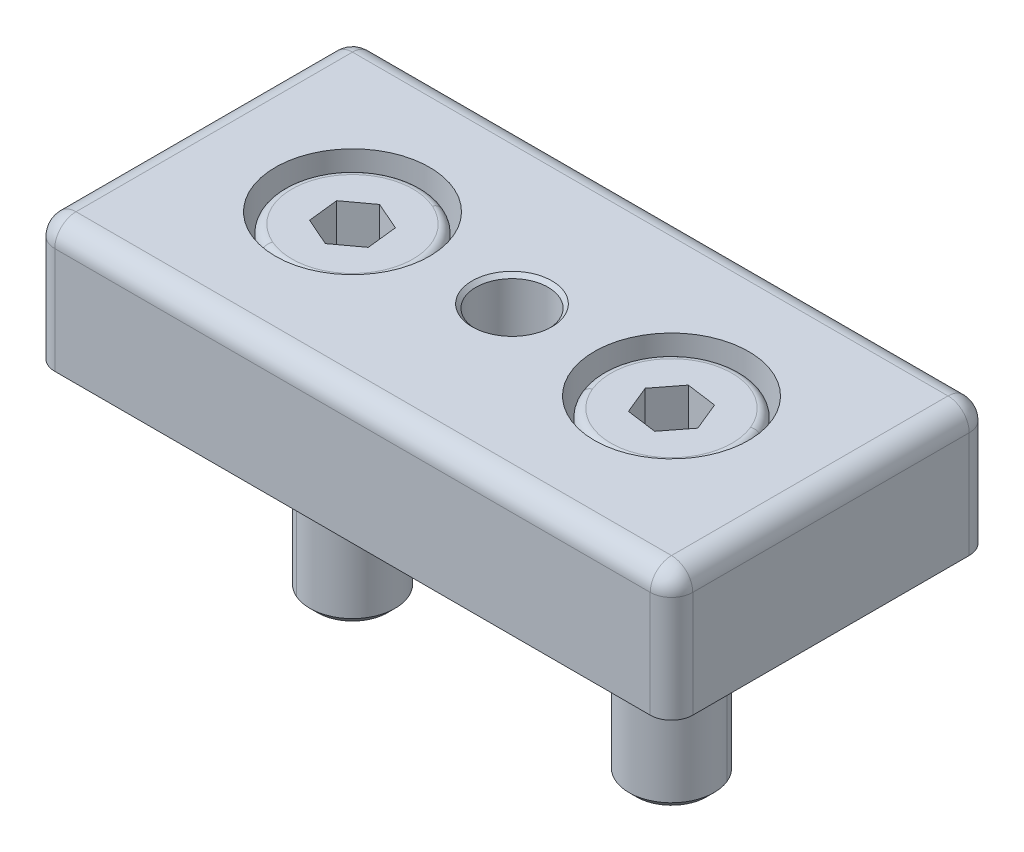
ISO-10303-21;
HEADER;
FILE_DESCRIPTION(('STEP AP214'),'2;1');
FILE_NAME('part.step','',(''),(''),'','','');
FILE_SCHEMA(('AUTOMOTIVE_DESIGN { 1 0 10303 214 1 1 1 1 }'));
ENDSEC;
DATA;
#1=APPLICATION_CONTEXT('core data for automotive mechanical design processes');
#2=APPLICATION_PROTOCOL_DEFINITION('international standard','automotive_design',2000,#1);
#3=PRODUCT_CONTEXT('',#1,'mechanical');
#4=PRODUCT('Part','Part','',(#3));
#5=PRODUCT_RELATED_PRODUCT_CATEGORY('part','',(#4));
#6=PRODUCT_DEFINITION_FORMATION('','',#4);
#7=PRODUCT_DEFINITION_CONTEXT('part definition',#1,'design');
#8=PRODUCT_DEFINITION('design','',#6,#7);
#9=PRODUCT_DEFINITION_SHAPE('','',#8);
#10=(LENGTH_UNIT() NAMED_UNIT(*) SI_UNIT(.MILLI.,.METRE.));
#11=(NAMED_UNIT(*) PLANE_ANGLE_UNIT() SI_UNIT($,.RADIAN.));
#12=(NAMED_UNIT(*) SI_UNIT($,.STERADIAN.) SOLID_ANGLE_UNIT());
#13=UNCERTAINTY_MEASURE_WITH_UNIT(LENGTH_MEASURE(1.E-05),#10,'distance_accuracy_value','');
#14=(GEOMETRIC_REPRESENTATION_CONTEXT(3) GLOBAL_UNCERTAINTY_ASSIGNED_CONTEXT((#13)) GLOBAL_UNIT_ASSIGNED_CONTEXT((#10,
#11,#12)) REPRESENTATION_CONTEXT('',''));
#15=CARTESIAN_POINT('',(0.,0.,0.));
#16=DIRECTION('',(0.,0.,1.));
#17=DIRECTION('',(1.,0.,0.));
#18=AXIS2_PLACEMENT_3D('',#15,#16,#17);
#19=CARTESIAN_POINT('',(-34.1686525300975,-3.25716267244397,-15.7507184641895));
#20=DIRECTION('',(-1.,0.,0.));
#21=DIRECTION('',(0.,0.,1.));
#22=AXIS2_PLACEMENT_3D('',#19,#20,#21);
#23=PLANE('',#22);
#24=DIRECTION('',(0.,1.,0.));
#25=VECTOR('',#24,1.);
#26=CARTESIAN_POINT('',(-34.1686525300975,-3.25716267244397,-13.7507184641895));
#27=LINE('',#26,#25);
#28=CARTESIAN_POINT('',(-34.1686525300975,9.94283732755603,-13.7507184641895));
#29=VERTEX_POINT('',#28);
#30=CARTESIAN_POINT('',(-34.1686525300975,-0.0571626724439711,-13.7507184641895));
#31=VERTEX_POINT('',#30);
#32=EDGE_CURVE('P0_E165',#29,#31,#27,.F.);
#33=ORIENTED_EDGE('',*,*,#32,.T.);
#34=DIRECTION('',(0.,0.,-1.));
#35=VECTOR('',#34,1.);
#36=CARTESIAN_POINT('',(-34.1686525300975,-0.0571626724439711,12.2492815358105));
#37=LINE('',#36,#35);
#38=CARTESIAN_POINT('',(-34.1686525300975,-0.0571626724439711,12.2492815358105));
#39=VERTEX_POINT('',#38);
#40=EDGE_CURVE('P0_E127',#39,#31,#37,.T.);
#41=ORIENTED_EDGE('',*,*,#40,.F.);
#42=DIRECTION('',(0.,1.,0.));
#43=VECTOR('',#42,1.);
#44=CARTESIAN_POINT('',(-34.1686525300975,-3.25716267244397,12.2492815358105));
#45=LINE('',#44,#43);
#46=CARTESIAN_POINT('',(-34.1686525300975,9.94283732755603,12.2492815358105));
#47=VERTEX_POINT('',#46);
#48=EDGE_CURVE('P0_E154',#39,#47,#45,.T.);
#49=ORIENTED_EDGE('',*,*,#48,.T.);
#50=DIRECTION('',(0.,0.,1.));
#51=VECTOR('',#50,1.);
#52=CARTESIAN_POINT('',(-34.1686525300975,9.94283732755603,-15.7507184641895));
#53=LINE('',#52,#51);
#54=EDGE_CURVE('P0_E162',#47,#29,#53,.F.);
#55=ORIENTED_EDGE('',*,*,#54,.T.);
#56=EDGE_LOOP('',(#33,#41,#49,#55));
#57=FACE_BOUND('',#56,.T.);
#58=ADVANCED_FACE('P0_F46',(#57),#23,.T.);
#59=CARTESIAN_POINT('',(25.8313474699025,-3.25716267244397,-15.7507184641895));
#60=DIRECTION('',(0.,0.,-1.));
#61=DIRECTION('',(-1.,0.,0.));
#62=AXIS2_PLACEMENT_3D('',#59,#60,#61);
#63=PLANE('',#62);
#64=DIRECTION('',(0.,1.,0.));
#65=VECTOR('',#64,1.);
#66=CARTESIAN_POINT('',(23.8313474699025,-3.25716267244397,-15.7507184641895));
#67=LINE('',#66,#65);
#68=CARTESIAN_POINT('',(23.8313474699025,9.94283732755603,-15.7507184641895));
#69=VERTEX_POINT('',#68);
#70=CARTESIAN_POINT('',(23.8313474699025,-0.0571626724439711,-15.7507184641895));
#71=VERTEX_POINT('',#70);
#72=EDGE_CURVE('P0_E141',#69,#71,#67,.F.);
#73=ORIENTED_EDGE('',*,*,#72,.T.);
#74=DIRECTION('',(1.,0.,0.));
#75=VECTOR('',#74,1.);
#76=CARTESIAN_POINT('',(-32.1686525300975,-0.0571626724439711,-15.7507184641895));
#77=LINE('',#76,#75);
#78=CARTESIAN_POINT('',(-32.1686525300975,-0.0571626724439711,-15.7507184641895));
#79=VERTEX_POINT('',#78);
#80=EDGE_CURVE('P0_E64',#79,#71,#77,.T.);
#81=ORIENTED_EDGE('',*,*,#80,.F.);
#82=DIRECTION('',(0.,1.,0.));
#83=VECTOR('',#82,1.);
#84=CARTESIAN_POINT('',(-32.1686525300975,-3.25716267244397,-15.7507184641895));
#85=LINE('',#84,#83);
#86=CARTESIAN_POINT('',(-32.1686525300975,9.94283732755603,-15.7507184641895));
#87=VERTEX_POINT('',#86);
#88=EDGE_CURVE('P0_E138',#79,#87,#85,.T.);
#89=ORIENTED_EDGE('',*,*,#88,.T.);
#90=DIRECTION('',(-1.,0.,0.));
#91=VECTOR('',#90,1.);
#92=CARTESIAN_POINT('',(25.8313474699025,9.94283732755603,-15.7507184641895));
#93=LINE('',#92,#91);
#94=EDGE_CURVE('P0_E150',#87,#69,#93,.F.);
#95=ORIENTED_EDGE('',*,*,#94,.T.);
#96=EDGE_LOOP('',(#73,#81,#89,#95));
#97=FACE_BOUND('',#96,.T.);
#98=ADVANCED_FACE('P0_F137',(#97),#63,.T.);
#99=CARTESIAN_POINT('',(25.8313474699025,-3.25716267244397,14.2492815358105));
#100=DIRECTION('',(1.,0.,0.));
#101=DIRECTION('',(0.,0.,-1.));
#102=AXIS2_PLACEMENT_3D('',#99,#100,#101);
#103=PLANE('',#102);
#104=DIRECTION('',(0.,1.,0.));
#105=VECTOR('',#104,1.);
#106=CARTESIAN_POINT('',(25.8313474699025,-3.25716267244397,12.2492815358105));
#107=LINE('',#106,#105);
#108=CARTESIAN_POINT('',(25.8313474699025,9.94283732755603,12.2492815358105));
#109=VERTEX_POINT('',#108);
#110=CARTESIAN_POINT('',(25.8313474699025,-0.0571626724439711,12.2492815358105));
#111=VERTEX_POINT('',#110);
#112=EDGE_CURVE('P0_E267',#109,#111,#107,.F.);
#113=ORIENTED_EDGE('',*,*,#112,.T.);
#114=DIRECTION('',(0.,0.,1.));
#115=VECTOR('',#114,1.);
#116=CARTESIAN_POINT('',(25.8313474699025,-0.0571626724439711,-13.7507184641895));
#117=LINE('',#116,#115);
#118=CARTESIAN_POINT('',(25.8313474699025,-0.0571626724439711,-13.7507184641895));
#119=VERTEX_POINT('',#118);
#120=EDGE_CURVE('P0_E277',#119,#111,#117,.T.);
#121=ORIENTED_EDGE('',*,*,#120,.F.);
#122=DIRECTION('',(0.,1.,0.));
#123=VECTOR('',#122,1.);
#124=CARTESIAN_POINT('',(25.8313474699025,-3.25716267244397,-13.7507184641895));
#125=LINE('',#124,#123);
#126=CARTESIAN_POINT('',(25.8313474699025,9.94283732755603,-13.7507184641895));
#127=VERTEX_POINT('',#126);
#128=EDGE_CURVE('P0_E156',#119,#127,#125,.T.);
#129=ORIENTED_EDGE('',*,*,#128,.T.);
#130=DIRECTION('',(0.,0.,-1.));
#131=VECTOR('',#130,1.);
#132=CARTESIAN_POINT('',(25.8313474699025,9.94283732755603,14.2492815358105));
#133=LINE('',#132,#131);
#134=EDGE_CURVE('P0_E264',#127,#109,#133,.F.);
#135=ORIENTED_EDGE('',*,*,#134,.T.);
#136=EDGE_LOOP('',(#113,#121,#129,#135));
#137=FACE_BOUND('',#136,.T.);
#138=ADVANCED_FACE('P0_F274',(#137),#103,.T.);
#139=CARTESIAN_POINT('',(-34.1686525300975,-3.25716267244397,14.2492815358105));
#140=DIRECTION('',(0.,0.,1.));
#141=DIRECTION('',(1.,0.,0.));
#142=AXIS2_PLACEMENT_3D('',#139,#140,#141);
#143=PLANE('',#142);
#144=DIRECTION('',(0.,1.,0.));
#145=VECTOR('',#144,1.);
#146=CARTESIAN_POINT('',(-32.1686525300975,-3.25716267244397,14.2492815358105));
#147=LINE('',#146,#145);
#148=CARTESIAN_POINT('',(-32.1686525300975,9.94283732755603,14.2492815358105));
#149=VERTEX_POINT('',#148);
#150=CARTESIAN_POINT('',(-32.1686525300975,-0.0571626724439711,14.2492815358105));
#151=VERTEX_POINT('',#150);
#152=EDGE_CURVE('P0_E181',#149,#151,#147,.F.);
#153=ORIENTED_EDGE('',*,*,#152,.T.);
#154=DIRECTION('',(-1.,0.,0.));
#155=VECTOR('',#154,1.);
#156=CARTESIAN_POINT('',(23.8313474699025,-0.0571626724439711,14.2492815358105));
#157=LINE('',#156,#155);
#158=CARTESIAN_POINT('',(23.8313474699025,-0.0571626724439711,14.2492815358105));
#159=VERTEX_POINT('',#158);
#160=EDGE_CURVE('P0_E298',#159,#151,#157,.T.);
#161=ORIENTED_EDGE('',*,*,#160,.F.);
#162=DIRECTION('',(0.,1.,0.));
#163=VECTOR('',#162,1.);
#164=CARTESIAN_POINT('',(23.8313474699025,-3.25716267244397,14.2492815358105));
#165=LINE('',#164,#163);
#166=CARTESIAN_POINT('',(23.8313474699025,9.94283732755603,14.2492815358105));
#167=VERTEX_POINT('',#166);
#168=EDGE_CURVE('P0_E11',#159,#167,#165,.T.);
#169=ORIENTED_EDGE('',*,*,#168,.T.);
#170=DIRECTION('',(1.,0.,0.));
#171=VECTOR('',#170,1.);
#172=CARTESIAN_POINT('',(-34.1686525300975,9.94283732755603,14.2492815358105));
#173=LINE('',#172,#171);
#174=EDGE_CURVE('P0_E56',#167,#149,#173,.F.);
#175=ORIENTED_EDGE('',*,*,#174,.T.);
#176=EDGE_LOOP('',(#153,#161,#169,#175));
#177=FACE_BOUND('',#176,.T.);
#178=ADVANCED_FACE('P0_F346',(#177),#143,.T.);
#179=CARTESIAN_POINT('',(-19.1686525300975,11.942837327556,-0.750718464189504));
#180=DIRECTION('',(0.,1.,0.));
#181=DIRECTION('',(0.,0.,1.));
#182=AXIS2_PLACEMENT_3D('',#179,#180,#181);
#183=CYLINDRICAL_SURFACE('',#182,4.50000000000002);
#184=CARTESIAN_POINT('',(-19.1686525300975,5.94283732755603,-0.750718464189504));
#185=DIRECTION('',(0.,1.,0.));
#186=DIRECTION('',(0.,0.,1.));
#187=AXIS2_PLACEMENT_3D('',#184,#185,#186);
#188=CIRCLE('',#187,4.50000000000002);
#189=CARTESIAN_POINT('',(-19.1686525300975,5.94283732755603,3.74928153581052));
#190=VERTEX_POINT('',#189);
#191=EDGE_CURVE('P0_E260',#190,#190,#188,.T.);
#192=ORIENTED_EDGE('',*,*,#191,.T.);
#193=EDGE_LOOP('',(#192));
#194=FACE_BOUND('',#193,.T.);
#195=CARTESIAN_POINT('',(-19.1686525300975,-0.0571626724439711,-0.750718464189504));
#196=DIRECTION('',(0.,-1.,0.));
#197=DIRECTION('',(0.,0.,-1.));
#198=AXIS2_PLACEMENT_3D('',#195,#196,#197);
#199=CIRCLE('',#198,4.50000000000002);
#200=CARTESIAN_POINT('',(-19.1686525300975,-0.0571626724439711,-5.25071846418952));
#201=VERTEX_POINT('',#200);
#202=EDGE_CURVE('P0_E133',#201,#201,#199,.T.);
#203=ORIENTED_EDGE('',*,*,#202,.T.);
#204=EDGE_LOOP('',(#203));
#205=FACE_BOUND('',#204,.T.);
#206=ADVANCED_FACE('P0_F414',(#194,#205),#183,.F.);
#207=CARTESIAN_POINT('',(10.8313474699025,11.942837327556,-0.750718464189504));
#208=DIRECTION('',(0.,1.,0.));
#209=DIRECTION('',(0.,0.,1.));
#210=AXIS2_PLACEMENT_3D('',#207,#208,#209);
#211=CYLINDRICAL_SURFACE('',#210,4.50000000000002);
#212=CARTESIAN_POINT('',(10.8313474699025,5.94283732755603,-0.750718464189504));
#213=DIRECTION('',(0.,1.,0.));
#214=DIRECTION('',(0.,0.,1.));
#215=AXIS2_PLACEMENT_3D('',#212,#213,#214);
#216=CIRCLE('',#215,4.50000000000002);
#217=CARTESIAN_POINT('',(10.8313474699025,5.94283732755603,3.74928153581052));
#218=VERTEX_POINT('',#217);
#219=EDGE_CURVE('P0_E244',#218,#218,#216,.T.);
#220=ORIENTED_EDGE('',*,*,#219,.T.);
#221=EDGE_LOOP('',(#220));
#222=FACE_BOUND('',#221,.T.);
#223=CARTESIAN_POINT('',(10.8313474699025,-0.0571626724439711,-0.750718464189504));
#224=DIRECTION('',(0.,-1.,0.));
#225=DIRECTION('',(0.,0.,-1.));
#226=AXIS2_PLACEMENT_3D('',#223,#224,#225);
#227=CIRCLE('',#226,4.50000000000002);
#228=CARTESIAN_POINT('',(10.8313474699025,-0.0571626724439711,-5.25071846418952));
#229=VERTEX_POINT('',#228);
#230=EDGE_CURVE('P0_E622',#229,#229,#227,.T.);
#231=ORIENTED_EDGE('',*,*,#230,.T.);
#232=EDGE_LOOP('',(#231));
#233=FACE_BOUND('',#232,.T.);
#234=ADVANCED_FACE('P0_F412',(#222,#233),#211,.F.);
#235=CARTESIAN_POINT('',(-32.1686525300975,-3.25716267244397,12.2492815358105));
#236=DIRECTION('',(0.,1.,0.));
#237=DIRECTION('',(0.,0.,1.));
#238=AXIS2_PLACEMENT_3D('',#235,#236,#237);
#239=CYLINDRICAL_SURFACE('',#238,2.);
#240=ORIENTED_EDGE('',*,*,#48,.F.);
#241=CARTESIAN_POINT('',(-32.1686525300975,-0.0571626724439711,12.2492815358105));
#242=DIRECTION('',(0.,-1.,0.));
#243=DIRECTION('',(0.,0.,-1.));
#244=AXIS2_PLACEMENT_3D('',#241,#242,#243);
#245=CIRCLE('',#244,2.);
#246=EDGE_CURVE('P0_E302',#151,#39,#245,.T.);
#247=ORIENTED_EDGE('',*,*,#246,.F.);
#248=ORIENTED_EDGE('',*,*,#152,.F.);
#249=CARTESIAN_POINT('',(-32.1686525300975,9.94283732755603,12.2492815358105));
#250=DIRECTION('',(0.,1.,0.));
#251=DIRECTION('',(0.,0.,1.));
#252=AXIS2_PLACEMENT_3D('',#249,#250,#251);
#253=CIRCLE('',#252,2.);
#254=EDGE_CURVE('P0_E228',#47,#149,#253,.T.);
#255=ORIENTED_EDGE('',*,*,#254,.F.);
#256=EDGE_LOOP('',(#240,#247,#248,#255));
#257=FACE_BOUND('',#256,.T.);
#258=ADVANCED_FACE('P0_F48',(#257),#239,.T.);
#259=CARTESIAN_POINT('',(23.8313474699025,-3.25716267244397,12.2492815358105));
#260=DIRECTION('',(0.,1.,0.));
#261=DIRECTION('',(0.,0.,1.));
#262=AXIS2_PLACEMENT_3D('',#259,#260,#261);
#263=CYLINDRICAL_SURFACE('',#262,2.);
#264=ORIENTED_EDGE('',*,*,#168,.F.);
#265=CARTESIAN_POINT('',(23.8313474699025,-0.0571626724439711,12.2492815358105));
#266=DIRECTION('',(0.,-1.,0.));
#267=DIRECTION('',(0.,0.,-1.));
#268=AXIS2_PLACEMENT_3D('',#265,#266,#267);
#269=CIRCLE('',#268,2.);
#270=EDGE_CURVE('P0_E296',#111,#159,#269,.T.);
#271=ORIENTED_EDGE('',*,*,#270,.F.);
#272=ORIENTED_EDGE('',*,*,#112,.F.);
#273=CARTESIAN_POINT('',(23.8313474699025,9.94283732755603,12.2492815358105));
#274=DIRECTION('',(0.,1.,0.));
#275=DIRECTION('',(0.,0.,1.));
#276=AXIS2_PLACEMENT_3D('',#273,#274,#275);
#277=CIRCLE('',#276,2.);
#278=EDGE_CURVE('P0_E217',#167,#109,#277,.T.);
#279=ORIENTED_EDGE('',*,*,#278,.F.);
#280=EDGE_LOOP('',(#264,#271,#272,#279));
#281=FACE_BOUND('',#280,.T.);
#282=ADVANCED_FACE('P0_F294',(#281),#263,.T.);
#283=CARTESIAN_POINT('',(-32.1686525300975,-3.25716267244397,-13.7507184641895));
#284=DIRECTION('',(0.,1.,0.));
#285=DIRECTION('',(0.,0.,1.));
#286=AXIS2_PLACEMENT_3D('',#283,#284,#285);
#287=CYLINDRICAL_SURFACE('',#286,2.);
#288=ORIENTED_EDGE('',*,*,#88,.F.);
#289=CARTESIAN_POINT('',(-32.1686525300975,-0.0571626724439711,-13.7507184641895));
#290=DIRECTION('',(0.,-1.,0.));
#291=DIRECTION('',(0.,0.,-1.));
#292=AXIS2_PLACEMENT_3D('',#289,#290,#291);
#293=CIRCLE('',#292,2.);
#294=EDGE_CURVE('P0_E123',#31,#79,#293,.T.);
#295=ORIENTED_EDGE('',*,*,#294,.F.);
#296=ORIENTED_EDGE('',*,*,#32,.F.);
#297=CARTESIAN_POINT('',(-32.1686525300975,9.94283732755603,-13.7507184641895));
#298=DIRECTION('',(0.,1.,0.));
#299=DIRECTION('',(0.,0.,1.));
#300=AXIS2_PLACEMENT_3D('',#297,#298,#299);
#301=CIRCLE('',#300,2.);
#302=EDGE_CURVE('P0_E147',#87,#29,#301,.T.);
#303=ORIENTED_EDGE('',*,*,#302,.F.);
#304=EDGE_LOOP('',(#288,#295,#296,#303));
#305=FACE_BOUND('',#304,.T.);
#306=ADVANCED_FACE('P0_F145',(#305),#287,.T.);
#307=CARTESIAN_POINT('',(23.8313474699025,-3.25716267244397,-13.7507184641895));
#308=DIRECTION('',(0.,1.,0.));
#309=DIRECTION('',(0.,0.,1.));
#310=AXIS2_PLACEMENT_3D('',#307,#308,#309);
#311=CYLINDRICAL_SURFACE('',#310,2.);
#312=ORIENTED_EDGE('',*,*,#128,.F.);
#313=CARTESIAN_POINT('',(23.8313474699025,-0.0571626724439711,-13.7507184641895));
#314=DIRECTION('',(0.,-1.,0.));
#315=DIRECTION('',(0.,0.,-1.));
#316=AXIS2_PLACEMENT_3D('',#313,#314,#315);
#317=CIRCLE('',#316,2.);
#318=EDGE_CURVE('P0_E143',#71,#119,#317,.T.);
#319=ORIENTED_EDGE('',*,*,#318,.F.);
#320=ORIENTED_EDGE('',*,*,#72,.F.);
#321=CARTESIAN_POINT('',(23.8313474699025,9.94283732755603,-13.7507184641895));
#322=DIRECTION('',(0.,1.,0.));
#323=DIRECTION('',(0.,0.,1.));
#324=AXIS2_PLACEMENT_3D('',#321,#322,#323);
#325=CIRCLE('',#324,2.);
#326=EDGE_CURVE('P0_E187',#69,#127,#325,.F.);
#327=ORIENTED_EDGE('',*,*,#326,.T.);
#328=EDGE_LOOP('',(#312,#319,#320,#327));
#329=FACE_BOUND('',#328,.T.);
#330=ADVANCED_FACE('P0_F280',(#329),#311,.T.);
#331=CARTESIAN_POINT('',(-4.16865253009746,11.942837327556,-0.750718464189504));
#332=DIRECTION('',(0.,1.,0.));
#333=DIRECTION('',(0.,0.,1.));
#334=AXIS2_PLACEMENT_3D('',#331,#332,#333);
#335=CYLINDRICAL_SURFACE('',#334,3.4);
#336=CARTESIAN_POINT('',(-4.16865253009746,11.592837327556,-0.750718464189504));
#337=DIRECTION('',(0.,1.,0.));
#338=DIRECTION('',(0.,0.,1.));
#339=AXIS2_PLACEMENT_3D('',#336,#337,#338);
#340=CIRCLE('',#339,3.4);
#341=CARTESIAN_POINT('',(-4.16865253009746,11.592837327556,2.64928153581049));
#342=VERTEX_POINT('',#341);
#343=EDGE_CURVE('P0_E192',#342,#342,#340,.T.);
#344=ORIENTED_EDGE('',*,*,#343,.T.);
#345=EDGE_LOOP('',(#344));
#346=FACE_BOUND('',#345,.T.);
#347=CARTESIAN_POINT('',(-4.16865253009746,-0.0571626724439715,-0.750718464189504));
#348=DIRECTION('',(0.,-1.,0.));
#349=DIRECTION('',(0.,0.,-1.));
#350=AXIS2_PLACEMENT_3D('',#347,#348,#349);
#351=CIRCLE('',#350,3.4);
#352=CARTESIAN_POINT('',(-4.16865253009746,-0.0571626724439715,-4.1507184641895));
#353=VERTEX_POINT('',#352);
#354=EDGE_CURVE('P0_E50',#353,#353,#351,.F.);
#355=ORIENTED_EDGE('',*,*,#354,.F.);
#356=EDGE_LOOP('',(#355));
#357=FACE_BOUND('',#356,.T.);
#358=ADVANCED_FACE('P0_F321',(#346,#357),#335,.F.);
#359=CARTESIAN_POINT('',(-4.16865253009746,11.942837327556,-0.750718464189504));
#360=DIRECTION('',(0.,1.,0.));
#361=DIRECTION('',(0.,0.,1.));
#362=AXIS2_PLACEMENT_3D('',#359,#360,#361);
#363=PLANE('',#362);
#364=CARTESIAN_POINT('',(-4.16865253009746,11.942837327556,-0.750718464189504));
#365=DIRECTION('',(0.,1.,0.));
#366=DIRECTION('',(0.,0.,1.));
#367=AXIS2_PLACEMENT_3D('',#364,#365,#366);
#368=CIRCLE('',#367,3.75);
#369=CARTESIAN_POINT('',(-4.16865253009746,11.942837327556,2.9992815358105));
#370=VERTEX_POINT('',#369);
#371=EDGE_CURVE('P0_E310',#370,#370,#368,.T.);
#372=ORIENTED_EDGE('',*,*,#371,.F.);
#373=EDGE_LOOP('',(#372));
#374=FACE_BOUND('',#373,.T.);
#375=DIRECTION('',(0.,0.,-1.));
#376=VECTOR('',#375,1.);
#377=CARTESIAN_POINT('',(23.8313474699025,11.942837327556,-0.750718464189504));
#378=LINE('',#377,#376);
#379=CARTESIAN_POINT('',(23.8313474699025,11.942837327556,12.2492815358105));
#380=VERTEX_POINT('',#379);
#381=CARTESIAN_POINT('',(23.8313474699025,11.942837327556,-13.7507184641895));
#382=VERTEX_POINT('',#381);
#383=EDGE_CURVE('P0_E174',#380,#382,#378,.T.);
#384=ORIENTED_EDGE('',*,*,#383,.T.);
#385=DIRECTION('',(-1.,0.,0.));
#386=VECTOR('',#385,1.);
#387=CARTESIAN_POINT('',(-4.16865253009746,11.942837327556,-13.7507184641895));
#388=LINE('',#387,#386);
#389=CARTESIAN_POINT('',(-32.1686525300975,11.942837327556,-13.7507184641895));
#390=VERTEX_POINT('',#389);
#391=EDGE_CURVE('P0_E177',#382,#390,#388,.T.);
#392=ORIENTED_EDGE('',*,*,#391,.T.);
#393=DIRECTION('',(0.,0.,1.));
#394=VECTOR('',#393,1.);
#395=CARTESIAN_POINT('',(-32.1686525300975,11.942837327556,-0.750718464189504));
#396=LINE('',#395,#394);
#397=CARTESIAN_POINT('',(-32.1686525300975,11.942837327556,12.2492815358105));
#398=VERTEX_POINT('',#397);
#399=EDGE_CURVE('P0_E171',#390,#398,#396,.T.);
#400=ORIENTED_EDGE('',*,*,#399,.T.);
#401=DIRECTION('',(1.,0.,0.));
#402=VECTOR('',#401,1.);
#403=CARTESIAN_POINT('',(-4.16865253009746,11.942837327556,12.2492815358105));
#404=LINE('',#403,#402);
#405=EDGE_CURVE('P0_E168',#398,#380,#404,.T.);
#406=ORIENTED_EDGE('',*,*,#405,.T.);
#407=EDGE_LOOP('',(#384,#392,#400,#406));
#408=FACE_BOUND('',#407,.T.);
#409=CARTESIAN_POINT('',(10.8313474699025,11.942837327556,-0.750718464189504));
#410=DIRECTION('',(0.,1.,0.));
#411=DIRECTION('',(0.,0.,1.));
#412=AXIS2_PLACEMENT_3D('',#409,#410,#411);
#413=CIRCLE('',#412,7.25000000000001);
#414=CARTESIAN_POINT('',(10.8313474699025,11.942837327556,6.4992815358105));
#415=VERTEX_POINT('',#414);
#416=EDGE_CURVE('P0_E231',#415,#415,#413,.T.);
#417=ORIENTED_EDGE('',*,*,#416,.F.);
#418=EDGE_LOOP('',(#417));
#419=FACE_BOUND('',#418,.T.);
#420=CARTESIAN_POINT('',(-19.1686525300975,11.942837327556,-0.750718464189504));
#421=DIRECTION('',(0.,1.,0.));
#422=DIRECTION('',(0.,0.,1.));
#423=AXIS2_PLACEMENT_3D('',#420,#421,#422);
#424=CIRCLE('',#423,7.25000000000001);
#425=CARTESIAN_POINT('',(-19.1686525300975,11.942837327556,6.4992815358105));
#426=VERTEX_POINT('',#425);
#427=EDGE_CURVE('P0_E252',#426,#426,#424,.T.);
#428=ORIENTED_EDGE('',*,*,#427,.F.);
#429=EDGE_LOOP('',(#428));
#430=FACE_BOUND('',#429,.T.);
#431=ADVANCED_FACE('P0_F323',(#374,#408,#419,#430),#363,.T.);
#432=CARTESIAN_POINT('',(-14.6686525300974,5.94283732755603,-0.750718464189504));
#433=DIRECTION('',(0.,-1.,0.));
#434=DIRECTION('',(0.,0.,-1.));
#435=AXIS2_PLACEMENT_3D('',#432,#433,#434);
#436=PLANE('',#435);
#437=ORIENTED_EDGE('',*,*,#191,.F.);
#438=EDGE_LOOP('',(#437));
#439=FACE_BOUND('',#438,.T.);
#440=CARTESIAN_POINT('',(-19.1686525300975,5.94283732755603,-0.750718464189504));
#441=DIRECTION('',(0.,1.,0.));
#442=DIRECTION('',(0.,0.,1.));
#443=AXIS2_PLACEMENT_3D('',#440,#441,#442);
#444=CIRCLE('',#443,7.25000000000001);
#445=CARTESIAN_POINT('',(-19.1686525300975,5.94283732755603,6.4992815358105));
#446=VERTEX_POINT('',#445);
#447=EDGE_CURVE('P0_E256',#446,#446,#444,.T.);
#448=ORIENTED_EDGE('',*,*,#447,.T.);
#449=EDGE_LOOP('',(#448));
#450=FACE_BOUND('',#449,.T.);
#451=ADVANCED_FACE('P0_F331',(#439,#450),#436,.F.);
#452=CARTESIAN_POINT('',(-19.1686525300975,11.942837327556,-0.750718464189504));
#453=DIRECTION('',(0.,1.,0.));
#454=DIRECTION('',(0.,0.,1.));
#455=AXIS2_PLACEMENT_3D('',#452,#453,#454);
#456=CYLINDRICAL_SURFACE('',#455,7.25000000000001);
#457=ORIENTED_EDGE('',*,*,#447,.F.);
#458=EDGE_LOOP('',(#457));
#459=FACE_BOUND('',#458,.T.);
#460=ORIENTED_EDGE('',*,*,#427,.T.);
#461=EDGE_LOOP('',(#460));
#462=FACE_BOUND('',#461,.T.);
#463=ADVANCED_FACE('P0_F398',(#459,#462),#456,.F.);
#464=CARTESIAN_POINT('',(15.3313474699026,5.94283732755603,-0.750718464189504));
#465=DIRECTION('',(0.,-1.,0.));
#466=DIRECTION('',(0.,0.,-1.));
#467=AXIS2_PLACEMENT_3D('',#464,#465,#466);
#468=PLANE('',#467);
#469=ORIENTED_EDGE('',*,*,#219,.F.);
#470=EDGE_LOOP('',(#469));
#471=FACE_BOUND('',#470,.T.);
#472=CARTESIAN_POINT('',(10.8313474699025,5.94283732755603,-0.750718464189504));
#473=DIRECTION('',(0.,1.,0.));
#474=DIRECTION('',(0.,0.,1.));
#475=AXIS2_PLACEMENT_3D('',#472,#473,#474);
#476=CIRCLE('',#475,7.25000000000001);
#477=CARTESIAN_POINT('',(10.8313474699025,5.94283732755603,6.4992815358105));
#478=VERTEX_POINT('',#477);
#479=EDGE_CURVE('P0_E238',#478,#478,#476,.T.);
#480=ORIENTED_EDGE('',*,*,#479,.T.);
#481=EDGE_LOOP('',(#480));
#482=FACE_BOUND('',#481,.T.);
#483=ADVANCED_FACE('P0_F381',(#471,#482),#468,.F.);
#484=CARTESIAN_POINT('',(10.8313474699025,11.942837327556,-0.750718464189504));
#485=DIRECTION('',(0.,1.,0.));
#486=DIRECTION('',(0.,0.,1.));
#487=AXIS2_PLACEMENT_3D('',#484,#485,#486);
#488=CYLINDRICAL_SURFACE('',#487,7.25000000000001);
#489=ORIENTED_EDGE('',*,*,#479,.F.);
#490=EDGE_LOOP('',(#489));
#491=FACE_BOUND('',#490,.T.);
#492=ORIENTED_EDGE('',*,*,#416,.T.);
#493=EDGE_LOOP('',(#492));
#494=FACE_BOUND('',#493,.T.);
#495=ADVANCED_FACE('P0_F377',(#491,#494),#488,.F.);
#496=CARTESIAN_POINT('',(-32.1686525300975,9.94283732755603,12.2492815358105));
#497=DIRECTION('',(0.,0.,1.));
#498=DIRECTION('',(1.,0.,0.));
#499=AXIS2_PLACEMENT_3D('',#496,#497,#498);
#500=SPHERICAL_SURFACE('',#499,2.);
#501=CARTESIAN_POINT('',(-32.1686525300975,9.94283732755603,12.2492815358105));
#502=DIRECTION('',(0.,0.,1.));
#503=DIRECTION('',(1.,0.,0.));
#504=AXIS2_PLACEMENT_3D('',#501,#502,#503);
#505=CIRCLE('',#504,2.);
#506=EDGE_CURVE('P0_E221',#47,#398,#505,.F.);
#507=ORIENTED_EDGE('',*,*,#506,.F.);
#508=ORIENTED_EDGE('',*,*,#254,.T.);
#509=CARTESIAN_POINT('',(-32.1686525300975,9.94283732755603,12.2492815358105));
#510=DIRECTION('',(-1.,0.,0.));
#511=DIRECTION('',(0.,0.,1.));
#512=AXIS2_PLACEMENT_3D('',#509,#510,#511);
#513=CIRCLE('',#512,2.);
#514=EDGE_CURVE('P0_E225',#398,#149,#513,.F.);
#515=ORIENTED_EDGE('',*,*,#514,.F.);
#516=EDGE_LOOP('',(#507,#508,#515));
#517=FACE_BOUND('',#516,.T.);
#518=ADVANCED_FACE('P0_F373',(#517),#500,.T.);
#519=CARTESIAN_POINT('',(-4.16865253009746,9.94283732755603,12.2492815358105));
#520=DIRECTION('',(1.,0.,0.));
#521=DIRECTION('',(0.,0.,-1.));
#522=AXIS2_PLACEMENT_3D('',#519,#520,#521);
#523=CYLINDRICAL_SURFACE('',#522,2.);
#524=ORIENTED_EDGE('',*,*,#514,.T.);
#525=ORIENTED_EDGE('',*,*,#174,.F.);
#526=CARTESIAN_POINT('',(23.8313474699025,9.94283732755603,12.2492815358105));
#527=DIRECTION('',(1.,0.,0.));
#528=DIRECTION('',(0.,0.,-1.));
#529=AXIS2_PLACEMENT_3D('',#526,#527,#528);
#530=CIRCLE('',#529,2.);
#531=EDGE_CURVE('P0_E213',#380,#167,#530,.T.);
#532=ORIENTED_EDGE('',*,*,#531,.F.);
#533=ORIENTED_EDGE('',*,*,#405,.F.);
#534=EDGE_LOOP('',(#524,#525,#532,#533));
#535=FACE_BOUND('',#534,.T.);
#536=ADVANCED_FACE('P0_F369',(#535),#523,.T.);
#537=CARTESIAN_POINT('',(-32.1686525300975,9.94283732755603,-0.750718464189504));
#538=DIRECTION('',(0.,0.,1.));
#539=DIRECTION('',(1.,0.,0.));
#540=AXIS2_PLACEMENT_3D('',#537,#538,#539);
#541=CYLINDRICAL_SURFACE('',#540,2.);
#542=ORIENTED_EDGE('',*,*,#506,.T.);
#543=ORIENTED_EDGE('',*,*,#399,.F.);
#544=CARTESIAN_POINT('',(-32.1686525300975,9.94283732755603,-13.7507184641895));
#545=DIRECTION('',(0.,0.,-1.));
#546=DIRECTION('',(-1.,0.,0.));
#547=AXIS2_PLACEMENT_3D('',#544,#545,#546);
#548=CIRCLE('',#547,2.);
#549=EDGE_CURVE('P0_E209',#29,#390,#548,.T.);
#550=ORIENTED_EDGE('',*,*,#549,.F.);
#551=ORIENTED_EDGE('',*,*,#54,.F.);
#552=EDGE_LOOP('',(#542,#543,#550,#551));
#553=FACE_BOUND('',#552,.T.);
#554=ADVANCED_FACE('P0_F364',(#553),#541,.T.);
#555=CARTESIAN_POINT('',(23.8313474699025,9.94283732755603,12.2492815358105));
#556=DIRECTION('',(0.,0.,1.));
#557=DIRECTION('',(1.,0.,0.));
#558=AXIS2_PLACEMENT_3D('',#555,#556,#557);
#559=SPHERICAL_SURFACE('',#558,2.);
#560=ORIENTED_EDGE('',*,*,#531,.T.);
#561=ORIENTED_EDGE('',*,*,#278,.T.);
#562=CARTESIAN_POINT('',(23.8313474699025,9.94283732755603,12.2492815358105));
#563=DIRECTION('',(0.,0.,1.));
#564=DIRECTION('',(1.,0.,0.));
#565=AXIS2_PLACEMENT_3D('',#562,#563,#564);
#566=CIRCLE('',#565,2.);
#567=EDGE_CURVE('P0_E203',#380,#109,#566,.F.);
#568=ORIENTED_EDGE('',*,*,#567,.F.);
#569=EDGE_LOOP('',(#560,#561,#568));
#570=FACE_BOUND('',#569,.T.);
#571=ADVANCED_FACE('P0_F290',(#570),#559,.T.);
#572=CARTESIAN_POINT('',(-32.1686525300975,9.94283732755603,-13.7507184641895));
#573=DIRECTION('',(-1.,0.,0.));
#574=DIRECTION('',(0.,0.,1.));
#575=AXIS2_PLACEMENT_3D('',#572,#573,#574);
#576=SPHERICAL_SURFACE('',#575,2.);
#577=ORIENTED_EDGE('',*,*,#302,.T.);
#578=ORIENTED_EDGE('',*,*,#549,.T.);
#579=CARTESIAN_POINT('',(-32.1686525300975,9.94283732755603,-13.7507184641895));
#580=DIRECTION('',(-1.,0.,0.));
#581=DIRECTION('',(0.,0.,1.));
#582=AXIS2_PLACEMENT_3D('',#579,#580,#581);
#583=CIRCLE('',#582,2.);
#584=EDGE_CURVE('P0_E200',#87,#390,#583,.F.);
#585=ORIENTED_EDGE('',*,*,#584,.F.);
#586=EDGE_LOOP('',(#577,#578,#585));
#587=FACE_BOUND('',#586,.T.);
#588=ADVANCED_FACE('P0_F358',(#587),#576,.T.);
#589=CARTESIAN_POINT('',(23.8313474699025,9.94283732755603,-0.750718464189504));
#590=DIRECTION('',(0.,0.,-1.));
#591=DIRECTION('',(-1.,0.,0.));
#592=AXIS2_PLACEMENT_3D('',#589,#590,#591);
#593=CYLINDRICAL_SURFACE('',#592,2.);
#594=ORIENTED_EDGE('',*,*,#567,.T.);
#595=ORIENTED_EDGE('',*,*,#134,.F.);
#596=CARTESIAN_POINT('',(23.8313474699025,9.94283732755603,-13.7507184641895));
#597=DIRECTION('',(0.,0.,-1.));
#598=DIRECTION('',(-1.,0.,0.));
#599=AXIS2_PLACEMENT_3D('',#596,#597,#598);
#600=CIRCLE('',#599,2.);
#601=EDGE_CURVE('P0_E196',#382,#127,#600,.T.);
#602=ORIENTED_EDGE('',*,*,#601,.F.);
#603=ORIENTED_EDGE('',*,*,#383,.F.);
#604=EDGE_LOOP('',(#594,#595,#602,#603));
#605=FACE_BOUND('',#604,.T.);
#606=ADVANCED_FACE('P0_F287',(#605),#593,.T.);
#607=CARTESIAN_POINT('',(-4.16865253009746,9.94283732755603,-13.7507184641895));
#608=DIRECTION('',(-1.,0.,0.));
#609=DIRECTION('',(0.,0.,1.));
#610=AXIS2_PLACEMENT_3D('',#607,#608,#609);
#611=CYLINDRICAL_SURFACE('',#610,2.);
#612=ORIENTED_EDGE('',*,*,#584,.T.);
#613=ORIENTED_EDGE('',*,*,#391,.F.);
#614=CARTESIAN_POINT('',(23.8313474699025,9.94283732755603,-13.7507184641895));
#615=DIRECTION('',(1.,0.,0.));
#616=DIRECTION('',(0.,0.,-1.));
#617=AXIS2_PLACEMENT_3D('',#614,#615,#616);
#618=CIRCLE('',#617,2.);
#619=EDGE_CURVE('P0_E191',#69,#382,#618,.T.);
#620=ORIENTED_EDGE('',*,*,#619,.F.);
#621=ORIENTED_EDGE('',*,*,#94,.F.);
#622=EDGE_LOOP('',(#612,#613,#620,#621));
#623=FACE_BOUND('',#622,.T.);
#624=ADVANCED_FACE('P0_F352',(#623),#611,.T.);
#625=CARTESIAN_POINT('',(23.8313474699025,9.94283732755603,-13.7507184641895));
#626=DIRECTION('',(0.,1.,0.));
#627=DIRECTION('',(0.,0.,1.));
#628=AXIS2_PLACEMENT_3D('',#625,#626,#627);
#629=SPHERICAL_SURFACE('',#628,2.);
#630=ORIENTED_EDGE('',*,*,#619,.T.);
#631=ORIENTED_EDGE('',*,*,#601,.T.);
#632=ORIENTED_EDGE('',*,*,#326,.F.);
#633=EDGE_LOOP('',(#630,#631,#632));
#634=FACE_BOUND('',#633,.T.);
#635=ADVANCED_FACE('P0_F283',(#634),#629,.T.);
#636=CARTESIAN_POINT('',(-4.16865253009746,11.942837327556,-0.750718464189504));
#637=DIRECTION('',(0.,1.,0.));
#638=DIRECTION('',(0.,0.,1.));
#639=AXIS2_PLACEMENT_3D('',#636,#637,#638);
#640=CONICAL_SURFACE('',#639,3.75,0.785398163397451);
#641=ORIENTED_EDGE('',*,*,#343,.F.);
#642=EDGE_LOOP('',(#641));
#643=FACE_BOUND('',#642,.T.);
#644=ORIENTED_EDGE('',*,*,#371,.T.);
#645=EDGE_LOOP('',(#644));
#646=FACE_BOUND('',#645,.T.);
#647=ADVANCED_FACE('P0_F351',(#643,#646),#640,.F.);
#648=CARTESIAN_POINT('',(-32.1686525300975,-0.0571626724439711,-13.7507184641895));
#649=DIRECTION('',(0.,-1.,0.));
#650=DIRECTION('',(0.,0.,-1.));
#651=AXIS2_PLACEMENT_3D('',#648,#649,#650);
#652=PLANE('',#651);
#653=ORIENTED_EDGE('',*,*,#230,.F.);
#654=EDGE_LOOP('',(#653));
#655=FACE_BOUND('',#654,.T.);
#656=ORIENTED_EDGE('',*,*,#202,.F.);
#657=EDGE_LOOP('',(#656));
#658=FACE_BOUND('',#657,.T.);
#659=ORIENTED_EDGE('',*,*,#294,.T.);
#660=ORIENTED_EDGE('',*,*,#80,.T.);
#661=ORIENTED_EDGE('',*,*,#318,.T.);
#662=ORIENTED_EDGE('',*,*,#120,.T.);
#663=ORIENTED_EDGE('',*,*,#270,.T.);
#664=ORIENTED_EDGE('',*,*,#160,.T.);
#665=ORIENTED_EDGE('',*,*,#246,.T.);
#666=ORIENTED_EDGE('',*,*,#40,.T.);
#667=EDGE_LOOP('',(#659,#660,#661,#662,#663,#664,#665,#666));
#668=FACE_BOUND('',#667,.T.);
#669=ORIENTED_EDGE('',*,*,#354,.T.);
#670=EDGE_LOOP('',(#669));
#671=FACE_BOUND('',#670,.T.);
#672=ADVANCED_FACE('P0_F124',(#655,#658,#668,#671),#652,.T.);
#673=CLOSED_SHELL('',(#58,#98,#138,#178,#206,#234,#258,#282,#306,#330,#358,#431,#451,#463,#483,
#495,#518,#536,#554,#571,#588,#606,#624,#635,#647,#672));
#674=MANIFOLD_SOLID_BREP('P0_B2',#673);
#675=CARTESIAN_POINT('',(-19.1686525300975,7.14283732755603,-0.750718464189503));
#676=DIRECTION('',(0.,1.,0.));
#677=DIRECTION('',(-0.401494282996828,0.,0.915861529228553));
#678=AXIS2_PLACEMENT_3D('',#675,#676,#677);
#679=CONICAL_SURFACE('',#678,2.5,1.0471975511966);
#680=DIRECTION('',(0.347704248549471,0.5,-0.793159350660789));
#681=VECTOR('',#680,1.);
#682=CARTESIAN_POINT('',(-18.1649168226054,7.14283732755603,-3.04037228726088));
#683=LINE('',#682,#681);
#684=CARTESIAN_POINT('',(-19.1686525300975,5.69946165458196,-0.750718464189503));
#685=VERTEX_POINT('',#684);
#686=CARTESIAN_POINT('',(-18.1649168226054,7.14283732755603,-3.04037228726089));
#687=VERTEX_POINT('',#686);
#688=EDGE_CURVE('P1_E333',#685,#687,#683,.T.);
#689=ORIENTED_EDGE('',*,*,#688,.F.);
#690=DIRECTION('',(-0.347704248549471,0.5,0.793159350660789));
#691=VECTOR('',#690,1.);
#692=CARTESIAN_POINT('',(-20.1723882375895,7.14283732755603,1.53893535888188));
#693=LINE('',#692,#691);
#694=CARTESIAN_POINT('',(-20.1723882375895,7.14283732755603,1.53893535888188));
#695=VERTEX_POINT('',#694);
#696=EDGE_CURVE('P1_E336',#685,#695,#693,.T.);
#697=ORIENTED_EDGE('',*,*,#696,.T.);
#698=CARTESIAN_POINT('',(-19.1686525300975,7.14283732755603,-0.750718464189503));
#699=DIRECTION('',(0.,1.,0.));
#700=DIRECTION('',(-0.401494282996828,0.,0.915861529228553));
#701=AXIS2_PLACEMENT_3D('',#698,#699,#700);
#702=CIRCLE('',#701,2.5);
#703=CARTESIAN_POINT('',(-17.6876220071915,7.14283732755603,1.26336906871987));
#704=VERTEX_POINT('',#703);
#705=EDGE_CURVE('P1_E11',#695,#704,#702,.T.);
#706=ORIENTED_EDGE('',*,*,#705,.T.);
#707=CARTESIAN_POINT('',(-19.1686525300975,7.14283732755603,-0.750718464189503));
#708=DIRECTION('',(0.,1.,0.));
#709=DIRECTION('',(-0.401494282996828,0.,0.915861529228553));
#710=AXIS2_PLACEMENT_3D('',#707,#708,#709);
#711=CIRCLE('',#710,2.5);
#712=CARTESIAN_POINT('',(-16.6838862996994,7.14283732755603,-1.02628475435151));
#713=VERTEX_POINT('',#712);
#714=EDGE_CURVE('P1_E26',#704,#713,#711,.T.);
#715=ORIENTED_EDGE('',*,*,#714,.T.);
#716=CARTESIAN_POINT('',(-19.1686525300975,7.14283732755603,-0.750718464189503));
#717=DIRECTION('',(0.,1.,0.));
#718=DIRECTION('',(-0.401494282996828,0.,0.915861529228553));
#719=AXIS2_PLACEMENT_3D('',#716,#717,#718);
#720=CIRCLE('',#719,2.5);
#721=EDGE_CURVE('P1_E19',#713,#687,#720,.T.);
#722=ORIENTED_EDGE('',*,*,#721,.T.);
#723=EDGE_LOOP('',(#689,#697,#706,#715,#722));
#724=FACE_BOUND('',#723,.T.);
#725=ADVANCED_FACE('P1_F16',(#724),#679,.F.);
#726=CARTESIAN_POINT('',(-18.8504559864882,7.14283732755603,2.11844243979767));
#727=DIRECTION('',(0.,1.,0.));
#728=DIRECTION('',(-0.401494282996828,0.,0.915861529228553));
#729=AXIS2_PLACEMENT_3D('',#726,#727,#728);
#730=PLANE('',#729);
#731=ORIENTED_EDGE('',*,*,#705,.F.);
#732=DIRECTION('',(0.915861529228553,0.,0.401494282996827));
#733=VECTOR('',#732,1.);
#734=CARTESIAN_POINT('',(-21.4943204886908,7.14283732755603,0.959428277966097));
#735=LINE('',#734,#733);
#736=CARTESIAN_POINT('',(-18.8504559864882,7.14283732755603,2.11844243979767));
#737=VERTEX_POINT('',#736);
#738=EDGE_CURVE('P1_E294',#695,#737,#735,.T.);
#739=ORIENTED_EDGE('',*,*,#738,.T.);
#740=DIRECTION('',(-0.805635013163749,0.,0.592412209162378));
#741=VECTOR('',#740,1.);
#742=CARTESIAN_POINT('',(-16.5247880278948,7.14283732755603,0.408295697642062));
#743=LINE('',#742,#741);
#744=EDGE_CURVE('P1_E275',#704,#737,#743,.T.);
#745=ORIENTED_EDGE('',*,*,#744,.F.);
#746=EDGE_LOOP('',(#731,#739,#745));
#747=FACE_BOUND('',#746,.T.);
#748=ADVANCED_FACE('P1_F595',(#747),#730,.T.);
#749=CARTESIAN_POINT('',(-18.8504559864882,7.14283732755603,2.11844243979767));
#750=DIRECTION('',(0.,1.,0.));
#751=DIRECTION('',(-0.401494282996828,0.,0.915861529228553));
#752=AXIS2_PLACEMENT_3D('',#749,#750,#751);
#753=PLANE('',#752);
#754=ORIENTED_EDGE('',*,*,#714,.F.);
#755=DIRECTION('',(-0.805635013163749,0.,0.592412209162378));
#756=VECTOR('',#755,1.);
#757=CARTESIAN_POINT('',(-16.5247880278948,7.14283732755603,0.408295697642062));
#758=LINE('',#757,#756);
#759=CARTESIAN_POINT('',(-16.5247880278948,7.14283732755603,0.408295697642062));
#760=VERTEX_POINT('',#759);
#761=EDGE_CURVE('P1_E271',#760,#704,#758,.T.);
#762=ORIENTED_EDGE('',*,*,#761,.F.);
#763=DIRECTION('',(-0.110226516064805,0.,-0.993906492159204));
#764=VECTOR('',#763,1.);
#765=CARTESIAN_POINT('',(-16.5247880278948,7.14283732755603,0.408295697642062));
#766=LINE('',#765,#764);
#767=EDGE_CURVE('P1_E207',#760,#713,#766,.T.);
#768=ORIENTED_EDGE('',*,*,#767,.T.);
#769=EDGE_LOOP('',(#754,#762,#768));
#770=FACE_BOUND('',#769,.T.);
#771=ADVANCED_FACE('P1_F596',(#770),#753,.T.);
#772=CARTESIAN_POINT('',(-18.8504559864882,7.14283732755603,2.11844243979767));
#773=DIRECTION('',(0.,1.,0.));
#774=DIRECTION('',(-0.401494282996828,0.,0.915861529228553));
#775=AXIS2_PLACEMENT_3D('',#772,#773,#774);
#776=PLANE('',#775);
#777=ORIENTED_EDGE('',*,*,#721,.F.);
#778=DIRECTION('',(-0.110226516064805,0.,-0.993906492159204));
#779=VECTOR('',#778,1.);
#780=CARTESIAN_POINT('',(-16.5247880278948,7.14283732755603,0.408295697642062));
#781=LINE('',#780,#779);
#782=CARTESIAN_POINT('',(-16.8429845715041,7.14283732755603,-2.4608652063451));
#783=VERTEX_POINT('',#782);
#784=EDGE_CURVE('P1_E205',#713,#783,#781,.T.);
#785=ORIENTED_EDGE('',*,*,#784,.T.);
#786=DIRECTION('',(-0.915861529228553,0.,-0.401494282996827));
#787=VECTOR('',#786,1.);
#788=CARTESIAN_POINT('',(-16.8429845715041,7.14283732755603,-2.4608652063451));
#789=LINE('',#788,#787);
#790=EDGE_CURVE('P1_E175',#783,#687,#789,.T.);
#791=ORIENTED_EDGE('',*,*,#790,.T.);
#792=EDGE_LOOP('',(#777,#785,#791));
#793=FACE_BOUND('',#792,.T.);
#794=ADVANCED_FACE('P1_F606',(#793),#776,.T.);
#795=CARTESIAN_POINT('',(-18.8504559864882,7.14283732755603,2.11844243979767));
#796=DIRECTION('',(0.,1.,0.));
#797=DIRECTION('',(-0.401494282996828,0.,0.915861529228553));
#798=AXIS2_PLACEMENT_3D('',#795,#796,#797);
#799=PLANE('',#798);
#800=CARTESIAN_POINT('',(-19.1686525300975,7.14283732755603,-0.750718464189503));
#801=DIRECTION('',(0.,1.,0.));
#802=DIRECTION('',(-0.401494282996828,0.,0.915861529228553));
#803=AXIS2_PLACEMENT_3D('',#800,#801,#802);
#804=CIRCLE('',#803,2.5);
#805=CARTESIAN_POINT('',(-20.6496830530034,7.14283732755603,-2.76480599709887));
#806=VERTEX_POINT('',#805);
#807=EDGE_CURVE('P1_E170',#687,#806,#804,.T.);
#808=ORIENTED_EDGE('',*,*,#807,.F.);
#809=DIRECTION('',(-0.915861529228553,0.,-0.401494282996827));
#810=VECTOR('',#809,1.);
#811=CARTESIAN_POINT('',(-16.8429845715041,7.14283732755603,-2.4608652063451));
#812=LINE('',#811,#810);
#813=CARTESIAN_POINT('',(-19.4868490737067,7.14283732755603,-3.61987936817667));
#814=VERTEX_POINT('',#813);
#815=EDGE_CURVE('P1_E163',#687,#814,#812,.T.);
#816=ORIENTED_EDGE('',*,*,#815,.T.);
#817=DIRECTION('',(0.805635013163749,0.,-0.592412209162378));
#818=VECTOR('',#817,1.);
#819=CARTESIAN_POINT('',(-21.8125170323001,7.14283732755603,-1.90973262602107));
#820=LINE('',#819,#818);
#821=EDGE_CURVE('P1_E167',#806,#814,#820,.T.);
#822=ORIENTED_EDGE('',*,*,#821,.F.);
#823=EDGE_LOOP('',(#808,#816,#822));
#824=FACE_BOUND('',#823,.T.);
#825=ADVANCED_FACE('P1_F165',(#824),#799,.T.);
#826=CARTESIAN_POINT('',(-18.8504559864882,7.14283732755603,2.11844243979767));
#827=DIRECTION('',(0.,1.,0.));
#828=DIRECTION('',(-0.401494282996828,0.,0.915861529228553));
#829=AXIS2_PLACEMENT_3D('',#826,#827,#828);
#830=PLANE('',#829);
#831=CARTESIAN_POINT('',(-19.1686525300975,7.14283732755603,-0.750718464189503));
#832=DIRECTION('',(0.,1.,0.));
#833=DIRECTION('',(-0.401494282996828,0.,0.915861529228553));
#834=AXIS2_PLACEMENT_3D('',#831,#832,#833);
#835=CIRCLE('',#834,2.5);
#836=CARTESIAN_POINT('',(-21.6534187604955,7.14283732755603,-0.475152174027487));
#837=VERTEX_POINT('',#836);
#838=EDGE_CURVE('P1_E317',#806,#837,#835,.T.);
#839=ORIENTED_EDGE('',*,*,#838,.F.);
#840=DIRECTION('',(0.805635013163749,0.,-0.592412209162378));
#841=VECTOR('',#840,1.);
#842=CARTESIAN_POINT('',(-21.8125170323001,7.14283732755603,-1.90973262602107));
#843=LINE('',#842,#841);
#844=CARTESIAN_POINT('',(-21.8125170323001,7.14283732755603,-1.90973262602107));
#845=VERTEX_POINT('',#844);
#846=EDGE_CURVE('P1_E189',#845,#806,#843,.T.);
#847=ORIENTED_EDGE('',*,*,#846,.F.);
#848=DIRECTION('',(-0.110226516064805,0.,-0.993906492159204));
#849=VECTOR('',#848,1.);
#850=CARTESIAN_POINT('',(-21.4943204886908,7.14283732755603,0.959428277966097));
#851=LINE('',#850,#849);
#852=EDGE_CURVE('P1_E291',#837,#845,#851,.T.);
#853=ORIENTED_EDGE('',*,*,#852,.F.);
#854=EDGE_LOOP('',(#839,#847,#853));
#855=FACE_BOUND('',#854,.T.);
#856=ADVANCED_FACE('P1_F315',(#855),#830,.T.);
#857=CARTESIAN_POINT('',(-18.8504559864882,7.14283732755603,2.11844243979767));
#858=DIRECTION('',(0.,1.,0.));
#859=DIRECTION('',(-0.401494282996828,0.,0.915861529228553));
#860=AXIS2_PLACEMENT_3D('',#857,#858,#859);
#861=PLANE('',#860);
#862=CARTESIAN_POINT('',(-19.1686525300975,7.14283732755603,-0.750718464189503));
#863=DIRECTION('',(0.,1.,0.));
#864=DIRECTION('',(-0.401494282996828,0.,0.915861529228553));
#865=AXIS2_PLACEMENT_3D('',#862,#863,#864);
#866=CIRCLE('',#865,2.5);
#867=EDGE_CURVE('P1_E344',#837,#695,#866,.T.);
#868=ORIENTED_EDGE('',*,*,#867,.F.);
#869=DIRECTION('',(-0.110226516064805,0.,-0.993906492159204));
#870=VECTOR('',#869,1.);
#871=CARTESIAN_POINT('',(-21.4943204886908,7.14283732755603,0.959428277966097));
#872=LINE('',#871,#870);
#873=CARTESIAN_POINT('',(-21.4943204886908,7.14283732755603,0.959428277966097));
#874=VERTEX_POINT('',#873);
#875=EDGE_CURVE('P1_E302',#874,#837,#872,.T.);
#876=ORIENTED_EDGE('',*,*,#875,.F.);
#877=DIRECTION('',(0.915861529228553,0.,0.401494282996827));
#878=VECTOR('',#877,1.);
#879=CARTESIAN_POINT('',(-21.4943204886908,7.14283732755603,0.959428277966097));
#880=LINE('',#879,#878);
#881=EDGE_CURVE('P1_E297',#874,#695,#880,.T.);
#882=ORIENTED_EDGE('',*,*,#881,.T.);
#883=EDGE_LOOP('',(#868,#876,#882));
#884=FACE_BOUND('',#883,.T.);
#885=ADVANCED_FACE('P1_F587',(#884),#861,.T.);
#886=CARTESIAN_POINT('',(-16.5247880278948,7.14283732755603,0.408295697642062));
#887=DIRECTION('',(0.993906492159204,0.,-0.110226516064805));
#888=DIRECTION('',(0.,1.,0.));
#889=AXIS2_PLACEMENT_3D('',#886,#887,#888);
#890=PLANE('',#889);
#891=DIRECTION('',(-0.110226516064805,0.,-0.993906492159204));
#892=VECTOR('',#891,1.);
#893=CARTESIAN_POINT('',(-16.5247880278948,10.942837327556,0.408295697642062));
#894=LINE('',#893,#892);
#895=CARTESIAN_POINT('',(-16.5247880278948,10.942837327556,0.408295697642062));
#896=VERTEX_POINT('',#895);
#897=CARTESIAN_POINT('',(-16.8429845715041,10.942837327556,-2.4608652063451));
#898=VERTEX_POINT('',#897);
#899=EDGE_CURVE('P1_E260',#896,#898,#894,.T.);
#900=ORIENTED_EDGE('',*,*,#899,.T.);
#901=DIRECTION('',(0.,1.,0.));
#902=VECTOR('',#901,1.);
#903=CARTESIAN_POINT('',(-16.8429845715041,7.14283732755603,-2.4608652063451));
#904=LINE('',#903,#902);
#905=EDGE_CURVE('P1_E203',#783,#898,#904,.T.);
#906=ORIENTED_EDGE('',*,*,#905,.F.);
#907=ORIENTED_EDGE('',*,*,#784,.F.);
#908=ORIENTED_EDGE('',*,*,#767,.F.);
#909=DIRECTION('',(0.,1.,0.));
#910=VECTOR('',#909,1.);
#911=CARTESIAN_POINT('',(-16.5247880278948,7.14283732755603,0.408295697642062));
#912=LINE('',#911,#910);
#913=EDGE_CURVE('P1_E276',#760,#896,#912,.T.);
#914=ORIENTED_EDGE('',*,*,#913,.T.);
#915=EDGE_LOOP('',(#900,#906,#907,#908,#914));
#916=FACE_BOUND('',#915,.T.);
#917=ADVANCED_FACE('P1_F603',(#916),#890,.F.);
#918=CARTESIAN_POINT('',(-16.8429845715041,7.14283732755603,-2.4608652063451));
#919=DIRECTION('',(0.401494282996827,0.,-0.915861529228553));
#920=DIRECTION('',(-0.915861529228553,0.,-0.401494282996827));
#921=AXIS2_PLACEMENT_3D('',#918,#919,#920);
#922=PLANE('',#921);
#923=DIRECTION('',(-0.915861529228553,0.,-0.401494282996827));
#924=VECTOR('',#923,1.);
#925=CARTESIAN_POINT('',(-16.8429845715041,10.942837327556,-2.4608652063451));
#926=LINE('',#925,#924);
#927=CARTESIAN_POINT('',(-19.4868490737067,10.942837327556,-3.61987936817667));
#928=VERTEX_POINT('',#927);
#929=EDGE_CURVE('P1_E181',#898,#928,#926,.T.);
#930=ORIENTED_EDGE('',*,*,#929,.T.);
#931=DIRECTION('',(0.,1.,0.));
#932=VECTOR('',#931,1.);
#933=CARTESIAN_POINT('',(-19.4868490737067,7.14283732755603,-3.61987936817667));
#934=LINE('',#933,#932);
#935=EDGE_CURVE('P1_E176',#814,#928,#934,.T.);
#936=ORIENTED_EDGE('',*,*,#935,.F.);
#937=ORIENTED_EDGE('',*,*,#815,.F.);
#938=ORIENTED_EDGE('',*,*,#790,.F.);
#939=ORIENTED_EDGE('',*,*,#905,.T.);
#940=EDGE_LOOP('',(#930,#936,#937,#938,#939));
#941=FACE_BOUND('',#940,.T.);
#942=ADVANCED_FACE('P1_F179',(#941),#922,.F.);
#943=CARTESIAN_POINT('',(-21.8125170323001,7.14283732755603,-1.90973262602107));
#944=DIRECTION('',(0.592412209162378,0.,0.805635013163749));
#945=DIRECTION('',(0.,-1.,0.));
#946=AXIS2_PLACEMENT_3D('',#943,#944,#945);
#947=PLANE('',#946);
#948=DIRECTION('',(0.805635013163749,0.,-0.592412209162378));
#949=VECTOR('',#948,1.);
#950=CARTESIAN_POINT('',(-21.8125170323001,10.942837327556,-1.90973262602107));
#951=LINE('',#950,#949);
#952=CARTESIAN_POINT('',(-21.8125170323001,10.942837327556,-1.90973262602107));
#953=VERTEX_POINT('',#952);
#954=EDGE_CURVE('P1_E254',#953,#928,#951,.T.);
#955=ORIENTED_EDGE('',*,*,#954,.F.);
#956=DIRECTION('',(0.,1.,0.));
#957=VECTOR('',#956,1.);
#958=CARTESIAN_POINT('',(-21.8125170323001,7.14283732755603,-1.90973262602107));
#959=LINE('',#958,#957);
#960=EDGE_CURVE('P1_E197',#845,#953,#959,.T.);
#961=ORIENTED_EDGE('',*,*,#960,.F.);
#962=ORIENTED_EDGE('',*,*,#846,.T.);
#963=ORIENTED_EDGE('',*,*,#821,.T.);
#964=ORIENTED_EDGE('',*,*,#935,.T.);
#965=EDGE_LOOP('',(#955,#961,#962,#963,#964));
#966=FACE_BOUND('',#965,.T.);
#967=ADVANCED_FACE('P1_F187',(#966),#947,.T.);
#968=CARTESIAN_POINT('',(-21.4943204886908,7.14283732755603,0.959428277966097));
#969=DIRECTION('',(0.993906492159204,0.,-0.110226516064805));
#970=DIRECTION('',(0.,1.,0.));
#971=AXIS2_PLACEMENT_3D('',#968,#969,#970);
#972=PLANE('',#971);
#973=DIRECTION('',(-0.110226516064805,0.,-0.993906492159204));
#974=VECTOR('',#973,1.);
#975=CARTESIAN_POINT('',(-21.4943204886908,10.942837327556,0.959428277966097));
#976=LINE('',#975,#974);
#977=CARTESIAN_POINT('',(-21.4943204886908,10.942837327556,0.959428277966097));
#978=VERTEX_POINT('',#977);
#979=EDGE_CURVE('P1_E257',#978,#953,#976,.T.);
#980=ORIENTED_EDGE('',*,*,#979,.F.);
#981=DIRECTION('',(0.,1.,0.));
#982=VECTOR('',#981,1.);
#983=CARTESIAN_POINT('',(-21.4943204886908,7.14283732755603,0.959428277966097));
#984=LINE('',#983,#982);
#985=EDGE_CURVE('P1_E301',#874,#978,#984,.T.);
#986=ORIENTED_EDGE('',*,*,#985,.F.);
#987=ORIENTED_EDGE('',*,*,#875,.T.);
#988=ORIENTED_EDGE('',*,*,#852,.T.);
#989=ORIENTED_EDGE('',*,*,#960,.T.);
#990=EDGE_LOOP('',(#980,#986,#987,#988,#989));
#991=FACE_BOUND('',#990,.T.);
#992=ADVANCED_FACE('P1_F311',(#991),#972,.T.);
#993=CARTESIAN_POINT('',(-21.4943204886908,7.14283732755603,0.959428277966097));
#994=DIRECTION('',(-0.401494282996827,0.,0.915861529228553));
#995=DIRECTION('',(-0.915861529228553,0.,-0.401494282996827));
#996=AXIS2_PLACEMENT_3D('',#993,#994,#995);
#997=PLANE('',#996);
#998=DIRECTION('',(0.915861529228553,0.,0.401494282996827));
#999=VECTOR('',#998,1.);
#1000=CARTESIAN_POINT('',(-21.4943204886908,10.942837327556,0.959428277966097));
#1001=LINE('',#1000,#999);
#1002=CARTESIAN_POINT('',(-18.8504559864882,10.942837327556,2.11844243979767));
#1003=VERTEX_POINT('',#1002);
#1004=EDGE_CURVE('P1_E251',#978,#1003,#1001,.T.);
#1005=ORIENTED_EDGE('',*,*,#1004,.T.);
#1006=DIRECTION('',(0.,1.,0.));
#1007=VECTOR('',#1006,1.);
#1008=CARTESIAN_POINT('',(-18.8504559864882,7.14283732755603,2.11844243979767));
#1009=LINE('',#1008,#1007);
#1010=EDGE_CURVE('P1_E288',#737,#1003,#1009,.T.);
#1011=ORIENTED_EDGE('',*,*,#1010,.F.);
#1012=ORIENTED_EDGE('',*,*,#738,.F.);
#1013=ORIENTED_EDGE('',*,*,#881,.F.);
#1014=ORIENTED_EDGE('',*,*,#985,.T.);
#1015=EDGE_LOOP('',(#1005,#1011,#1012,#1013,#1014));
#1016=FACE_BOUND('',#1015,.T.);
#1017=ADVANCED_FACE('P1_F592',(#1016),#997,.F.);
#1018=CARTESIAN_POINT('',(-16.5247880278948,7.14283732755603,0.408295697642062));
#1019=DIRECTION('',(-0.592412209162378,0.,-0.805635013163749));
#1020=DIRECTION('',(0.805635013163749,0.,-0.592412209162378));
#1021=AXIS2_PLACEMENT_3D('',#1018,#1019,#1020);
#1022=PLANE('',#1021);
#1023=DIRECTION('',(-0.805635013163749,0.,0.592412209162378));
#1024=VECTOR('',#1023,1.);
#1025=CARTESIAN_POINT('',(-16.5247880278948,10.942837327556,0.408295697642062));
#1026=LINE('',#1025,#1024);
#1027=EDGE_CURVE('P1_E247',#896,#1003,#1026,.T.);
#1028=ORIENTED_EDGE('',*,*,#1027,.F.);
#1029=ORIENTED_EDGE('',*,*,#913,.F.);
#1030=ORIENTED_EDGE('',*,*,#761,.T.);
#1031=ORIENTED_EDGE('',*,*,#744,.T.);
#1032=ORIENTED_EDGE('',*,*,#1010,.T.);
#1033=EDGE_LOOP('',(#1028,#1029,#1030,#1031,#1032));
#1034=FACE_BOUND('',#1033,.T.);
#1035=ADVANCED_FACE('P1_F600',(#1034),#1022,.T.);
#1036=CARTESIAN_POINT('',(-19.1686525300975,10.142837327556,-0.750718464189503));
#1037=DIRECTION('',(0.,1.,0.));
#1038=DIRECTION('',(-0.401494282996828,0.,0.915861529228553));
#1039=AXIS2_PLACEMENT_3D('',#1036,#1037,#1038);
#1040=TOROIDAL_SURFACE('',#1039,5.7,0.8);
#1041=CARTESIAN_POINT('',(-16.8801351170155,10.142837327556,-5.97112918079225));
#1042=DIRECTION('',(0.915861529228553,0.,0.401494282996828));
#1043=DIRECTION('',(-0.401494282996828,0.,0.915861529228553));
#1044=AXIS2_PLACEMENT_3D('',#1041,#1042,#1043);
#1045=CIRCLE('',#1044,0.8);
#1046=CARTESIAN_POINT('',(-16.5589396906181,10.142837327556,-6.7038184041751));
#1047=VERTEX_POINT('',#1046);
#1048=CARTESIAN_POINT('',(-16.8801351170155,10.942837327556,-5.97112918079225));
#1049=VERTEX_POINT('',#1048);
#1050=EDGE_CURVE('P1_E343',#1047,#1049,#1045,.T.);
#1051=ORIENTED_EDGE('',*,*,#1050,.F.);
#1052=CARTESIAN_POINT('',(-19.1686525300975,10.142837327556,-0.750718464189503));
#1053=DIRECTION('',(0.,-1.,0.));
#1054=DIRECTION('',(-0.401494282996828,0.,0.915861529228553));
#1055=AXIS2_PLACEMENT_3D('',#1052,#1053,#1054);
#1056=CIRCLE('',#1055,6.5);
#1057=CARTESIAN_POINT('',(-21.7783653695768,10.142837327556,5.20238147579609));
#1058=VERTEX_POINT('',#1057);
#1059=EDGE_CURVE('P1_E267',#1058,#1047,#1056,.T.);
#1060=ORIENTED_EDGE('',*,*,#1059,.F.);
#1061=CARTESIAN_POINT('',(-21.4571699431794,10.142837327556,4.46969225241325));
#1062=DIRECTION('',(-0.915861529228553,0.,-0.401494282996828));
#1063=DIRECTION('',(0.401494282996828,0.,-0.915861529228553));
#1064=AXIS2_PLACEMENT_3D('',#1061,#1062,#1063);
#1065=CIRCLE('',#1064,0.8);
#1066=CARTESIAN_POINT('',(-21.4571699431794,10.942837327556,4.46969225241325));
#1067=VERTEX_POINT('',#1066);
#1068=EDGE_CURVE('P1_E362',#1058,#1067,#1065,.T.);
#1069=ORIENTED_EDGE('',*,*,#1068,.T.);
#1070=CARTESIAN_POINT('',(-19.1686525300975,10.942837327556,-0.750718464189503));
#1071=DIRECTION('',(0.,1.,0.));
#1072=DIRECTION('',(-0.401494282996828,0.,0.915861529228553));
#1073=AXIS2_PLACEMENT_3D('',#1070,#1071,#1072);
#1074=CIRCLE('',#1073,5.7);
#1075=EDGE_CURVE('P1_E244',#1049,#1067,#1074,.T.);
#1076=ORIENTED_EDGE('',*,*,#1075,.F.);
#1077=EDGE_LOOP('',(#1051,#1060,#1069,#1076));
#1078=FACE_BOUND('',#1077,.T.);
#1079=ADVANCED_FACE('P1_F636',(#1078),#1040,.T.);
#1080=CARTESIAN_POINT('',(-19.1686525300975,5.54283732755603,-0.750718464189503));
#1081=DIRECTION('',(0.,-1.,0.));
#1082=DIRECTION('',(0.401494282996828,0.,-0.915861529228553));
#1083=AXIS2_PLACEMENT_3D('',#1080,#1081,#1082);
#1084=TOROIDAL_SURFACE('',#1083,4.39999999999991,0.4);
#1085=CARTESIAN_POINT('',(-20.9352273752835,5.54283732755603,3.27907226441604));
#1086=DIRECTION('',(0.915861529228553,0.,0.401494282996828));
#1087=DIRECTION('',(-0.401494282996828,0.,0.915861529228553));
#1088=AXIS2_PLACEMENT_3D('',#1085,#1086,#1087);
#1089=CIRCLE('',#1088,0.4);
#1090=CARTESIAN_POINT('',(-20.7746296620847,5.54283732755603,2.91272765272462));
#1091=VERTEX_POINT('',#1090);
#1092=CARTESIAN_POINT('',(-20.9352273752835,5.94283732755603,3.27907226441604));
#1093=VERTEX_POINT('',#1092);
#1094=EDGE_CURVE('P1_E372',#1091,#1093,#1089,.T.);
#1095=ORIENTED_EDGE('',*,*,#1094,.F.);
#1096=CARTESIAN_POINT('',(-19.1686525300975,5.54283732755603,-0.750718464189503));
#1097=DIRECTION('',(0.,-1.,0.));
#1098=DIRECTION('',(0.401494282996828,0.,-0.915861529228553));
#1099=AXIS2_PLACEMENT_3D('',#1096,#1097,#1098);
#1100=CIRCLE('',#1099,3.99999999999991);
#1101=CARTESIAN_POINT('',(-17.5626753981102,5.54283732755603,-4.41416458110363));
#1102=VERTEX_POINT('',#1101);
#1103=EDGE_CURVE('P1_E227',#1102,#1091,#1100,.T.);
#1104=ORIENTED_EDGE('',*,*,#1103,.F.);
#1105=CARTESIAN_POINT('',(-17.4020776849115,5.54283732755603,-4.78050919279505));
#1106=DIRECTION('',(-0.915861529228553,0.,-0.401494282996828));
#1107=DIRECTION('',(0.401494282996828,0.,-0.915861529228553));
#1108=AXIS2_PLACEMENT_3D('',#1105,#1106,#1107);
#1109=CIRCLE('',#1108,0.4);
#1110=CARTESIAN_POINT('',(-17.4020776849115,5.94283732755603,-4.78050919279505));
#1111=VERTEX_POINT('',#1110);
#1112=EDGE_CURVE('P1_E354',#1102,#1111,#1109,.T.);
#1113=ORIENTED_EDGE('',*,*,#1112,.T.);
#1114=CARTESIAN_POINT('',(-19.1686525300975,5.94283732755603,-0.750718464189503));
#1115=DIRECTION('',(0.,1.,0.));
#1116=DIRECTION('',(0.401494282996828,0.,-0.915861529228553));
#1117=AXIS2_PLACEMENT_3D('',#1114,#1115,#1116);
#1118=CIRCLE('',#1117,4.39999999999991);
#1119=EDGE_CURVE('P1_E270',#1093,#1111,#1118,.T.);
#1120=ORIENTED_EDGE('',*,*,#1119,.F.);
#1121=EDGE_LOOP('',(#1095,#1104,#1113,#1120));
#1122=FACE_BOUND('',#1121,.T.);
#1123=ADVANCED_FACE('P1_F639',(#1122),#1084,.F.);
#1124=CARTESIAN_POINT('',(-16.1376087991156,-19.057162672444,0.578026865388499));
#1125=DIRECTION('',(0.,-1.,0.));
#1126=DIRECTION('',(0.915861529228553,0.,0.401494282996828));
#1127=AXIS2_PLACEMENT_3D('',#1124,#1125,#1126);
#1128=PLANE('',#1127);
#1129=CARTESIAN_POINT('',(-19.1686525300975,-19.057162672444,-0.750718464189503));
#1130=DIRECTION('',(0.,1.,0.));
#1131=DIRECTION('',(-0.401494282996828,0.,0.915861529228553));
#1132=AXIS2_PLACEMENT_3D('',#1129,#1130,#1131);
#1133=CIRCLE('',#1132,3.3095);
#1134=CARTESIAN_POINT('',(-20.4973978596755,-19.057162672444,2.28032526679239));
#1135=VERTEX_POINT('',#1134);
#1136=CARTESIAN_POINT('',(-17.8399072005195,-19.057162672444,-3.7817621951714));
#1137=VERTEX_POINT('',#1136);
#1138=EDGE_CURVE('P1_E350',#1135,#1137,#1133,.T.);
#1139=ORIENTED_EDGE('',*,*,#1138,.F.);
#1140=CARTESIAN_POINT('',(-19.1686525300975,-19.057162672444,-0.750718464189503));
#1141=DIRECTION('',(0.,1.,0.));
#1142=DIRECTION('',(-0.401494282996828,0.,0.915861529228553));
#1143=AXIS2_PLACEMENT_3D('',#1140,#1141,#1142);
#1144=CIRCLE('',#1143,3.3095);
#1145=EDGE_CURVE('P1_E280',#1137,#1135,#1144,.T.);
#1146=ORIENTED_EDGE('',*,*,#1145,.F.);
#1147=EDGE_LOOP('',(#1139,#1146));
#1148=FACE_BOUND('',#1147,.T.);
#1149=ADVANCED_FACE('P1_F645',(#1148),#1128,.T.);
#1150=CARTESIAN_POINT('',(-19.1686525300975,-19.057162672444,-0.750718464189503));
#1151=DIRECTION('',(0.,1.,0.));
#1152=DIRECTION('',(-0.401494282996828,0.,0.915861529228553));
#1153=AXIS2_PLACEMENT_3D('',#1150,#1151,#1152);
#1154=CONICAL_SURFACE('',#1153,3.3095,0.785398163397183);
#1155=DIRECTION('',(0.283899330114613,0.707106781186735,-0.647611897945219));
#1156=VECTOR('',#1155,1.);
#1157=CARTESIAN_POINT('',(-17.8399072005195,-19.057162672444,-3.7817621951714));
#1158=LINE('',#1157,#1156);
#1159=CARTESIAN_POINT('',(-17.5626753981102,-18.366662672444,-4.41416458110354));
#1160=VERTEX_POINT('',#1159);
#1161=EDGE_CURVE('P1_E345',#1137,#1160,#1158,.T.);
#1162=ORIENTED_EDGE('',*,*,#1161,.F.);
#1163=ORIENTED_EDGE('',*,*,#1145,.T.);
#1164=DIRECTION('',(-0.283899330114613,0.707106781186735,0.647611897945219));
#1165=VECTOR('',#1164,1.);
#1166=CARTESIAN_POINT('',(-20.4973978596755,-19.057162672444,2.28032526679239));
#1167=LINE('',#1166,#1165);
#1168=CARTESIAN_POINT('',(-20.7746296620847,-18.366662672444,2.91272765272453));
#1169=VERTEX_POINT('',#1168);
#1170=EDGE_CURVE('P1_E384',#1135,#1169,#1167,.T.);
#1171=ORIENTED_EDGE('',*,*,#1170,.T.);
#1172=CARTESIAN_POINT('',(-19.1686525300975,-18.366662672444,-0.750718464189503));
#1173=DIRECTION('',(0.,1.,0.));
#1174=DIRECTION('',(-0.401494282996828,0.,0.915861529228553));
#1175=AXIS2_PLACEMENT_3D('',#1172,#1173,#1174);
#1176=CIRCLE('',#1175,3.99999999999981);
#1177=EDGE_CURVE('P1_E277',#1160,#1169,#1176,.T.);
#1178=ORIENTED_EDGE('',*,*,#1177,.F.);
#1179=EDGE_LOOP('',(#1162,#1163,#1171,#1178));
#1180=FACE_BOUND('',#1179,.T.);
#1181=ADVANCED_FACE('P1_F649',(#1180),#1154,.T.);
#1182=CARTESIAN_POINT('',(-19.1686525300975,42.692837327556,-0.750718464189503));
#1183=DIRECTION('',(0.,1.,0.));
#1184=DIRECTION('',(-0.401494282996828,0.,0.915861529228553));
#1185=AXIS2_PLACEMENT_3D('',#1182,#1183,#1184);
#1186=CYLINDRICAL_SURFACE('',#1185,3.99999999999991);
#1187=DIRECTION('',(0.,1.,0.));
#1188=VECTOR('',#1187,1.);
#1189=CARTESIAN_POINT('',(-17.5626753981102,42.692837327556,-4.41416458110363));
#1190=LINE('',#1189,#1188);
#1191=EDGE_CURVE('P1_E225',#1160,#1102,#1190,.T.);
#1192=ORIENTED_EDGE('',*,*,#1191,.F.);
#1193=ORIENTED_EDGE('',*,*,#1177,.T.);
#1194=DIRECTION('',(0.,1.,0.));
#1195=VECTOR('',#1194,1.);
#1196=CARTESIAN_POINT('',(-20.7746296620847,42.692837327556,2.91272765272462));
#1197=LINE('',#1196,#1195);
#1198=EDGE_CURVE('P1_E231',#1169,#1091,#1197,.T.);
#1199=ORIENTED_EDGE('',*,*,#1198,.T.);
#1200=CARTESIAN_POINT('',(-19.1686525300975,5.54283732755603,-0.750718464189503));
#1201=DIRECTION('',(0.,-1.,0.));
#1202=DIRECTION('',(0.401494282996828,0.,-0.915861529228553));
#1203=AXIS2_PLACEMENT_3D('',#1200,#1201,#1202);
#1204=CIRCLE('',#1203,3.99999999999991);
#1205=EDGE_CURVE('P1_E366',#1091,#1102,#1204,.T.);
#1206=ORIENTED_EDGE('',*,*,#1205,.T.);
#1207=EDGE_LOOP('',(#1192,#1193,#1199,#1206));
#1208=FACE_BOUND('',#1207,.T.);
#1209=ADVANCED_FACE('P1_F414',(#1208),#1186,.T.);
#1210=CARTESIAN_POINT('',(-13.2155525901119,5.94283732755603,1.85899437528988));
#1211=DIRECTION('',(0.,-1.,0.));
#1212=DIRECTION('',(0.915861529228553,0.,0.401494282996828));
#1213=AXIS2_PLACEMENT_3D('',#1210,#1211,#1212);
#1214=PLANE('',#1213);
#1215=CARTESIAN_POINT('',(-19.1686525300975,5.94283732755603,-0.750718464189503));
#1216=DIRECTION('',(0.,1.,0.));
#1217=DIRECTION('',(0.401494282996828,0.,-0.915861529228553));
#1218=AXIS2_PLACEMENT_3D('',#1215,#1216,#1217);
#1219=CIRCLE('',#1218,4.39999999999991);
#1220=EDGE_CURVE('P1_E376',#1111,#1093,#1219,.T.);
#1221=ORIENTED_EDGE('',*,*,#1220,.T.);
#1222=ORIENTED_EDGE('',*,*,#1119,.T.);
#1223=EDGE_LOOP('',(#1221,#1222));
#1224=FACE_BOUND('',#1223,.T.);
#1225=CARTESIAN_POINT('',(-19.1686525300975,5.94283732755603,-0.750718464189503));
#1226=DIRECTION('',(0.,1.,0.));
#1227=DIRECTION('',(-0.401494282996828,0.,0.915861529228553));
#1228=AXIS2_PLACEMENT_3D('',#1225,#1226,#1227);
#1229=CIRCLE('',#1228,6.5);
#1230=CARTESIAN_POINT('',(-21.7783653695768,5.94283732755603,5.20238147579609));
#1231=VERTEX_POINT('',#1230);
#1232=CARTESIAN_POINT('',(-16.5589396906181,5.94283732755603,-6.7038184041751));
#1233=VERTEX_POINT('',#1232);
#1234=EDGE_CURVE('P1_E235',#1231,#1233,#1229,.T.);
#1235=ORIENTED_EDGE('',*,*,#1234,.F.);
#1236=CARTESIAN_POINT('',(-19.1686525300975,5.94283732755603,-0.750718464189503));
#1237=DIRECTION('',(0.,1.,0.));
#1238=DIRECTION('',(-0.401494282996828,0.,0.915861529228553));
#1239=AXIS2_PLACEMENT_3D('',#1236,#1237,#1238);
#1240=CIRCLE('',#1239,6.5);
#1241=EDGE_CURVE('P1_E264',#1233,#1231,#1240,.T.);
#1242=ORIENTED_EDGE('',*,*,#1241,.F.);
#1243=EDGE_LOOP('',(#1235,#1242));
#1244=FACE_BOUND('',#1243,.T.);
#1245=ADVANCED_FACE('P1_F655',(#1224,#1244),#1214,.T.);
#1246=CARTESIAN_POINT('',(-19.1686525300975,42.692837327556,-0.750718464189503));
#1247=DIRECTION('',(0.,1.,0.));
#1248=DIRECTION('',(-0.401494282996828,0.,0.915861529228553));
#1249=AXIS2_PLACEMENT_3D('',#1246,#1247,#1248);
#1250=CYLINDRICAL_SURFACE('',#1249,6.5);
#1251=DIRECTION('',(0.,1.,0.));
#1252=VECTOR('',#1251,1.);
#1253=CARTESIAN_POINT('',(-16.5589396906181,42.692837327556,-6.7038184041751));
#1254=LINE('',#1253,#1252);
#1255=EDGE_CURVE('P1_E236',#1233,#1047,#1254,.T.);
#1256=ORIENTED_EDGE('',*,*,#1255,.F.);
#1257=ORIENTED_EDGE('',*,*,#1241,.T.);
#1258=DIRECTION('',(0.,1.,0.));
#1259=VECTOR('',#1258,1.);
#1260=CARTESIAN_POINT('',(-21.7783653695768,42.692837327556,5.20238147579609));
#1261=LINE('',#1260,#1259);
#1262=EDGE_CURVE('P1_E240',#1231,#1058,#1261,.T.);
#1263=ORIENTED_EDGE('',*,*,#1262,.T.);
#1264=ORIENTED_EDGE('',*,*,#1059,.T.);
#1265=EDGE_LOOP('',(#1256,#1257,#1263,#1264));
#1266=FACE_BOUND('',#1265,.T.);
#1267=ADVANCED_FACE('P1_F658',(#1266),#1250,.T.);
#1268=CARTESIAN_POINT('',(-19.1686525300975,10.942837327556,-0.750718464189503));
#1269=DIRECTION('',(0.,1.,0.));
#1270=DIRECTION('',(-0.401494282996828,0.,0.915861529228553));
#1271=AXIS2_PLACEMENT_3D('',#1268,#1269,#1270);
#1272=PLANE('',#1271);
#1273=ORIENTED_EDGE('',*,*,#1027,.T.);
#1274=ORIENTED_EDGE('',*,*,#1004,.F.);
#1275=ORIENTED_EDGE('',*,*,#979,.T.);
#1276=ORIENTED_EDGE('',*,*,#954,.T.);
#1277=ORIENTED_EDGE('',*,*,#929,.F.);
#1278=ORIENTED_EDGE('',*,*,#899,.F.);
#1279=EDGE_LOOP('',(#1273,#1274,#1275,#1276,#1277,#1278));
#1280=FACE_BOUND('',#1279,.T.);
#1281=CARTESIAN_POINT('',(-19.1686525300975,10.942837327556,-0.750718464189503));
#1282=DIRECTION('',(0.,1.,0.));
#1283=DIRECTION('',(-0.401494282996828,0.,0.915861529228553));
#1284=AXIS2_PLACEMENT_3D('',#1281,#1282,#1283);
#1285=CIRCLE('',#1284,5.7);
#1286=EDGE_CURVE('P1_E358',#1067,#1049,#1285,.T.);
#1287=ORIENTED_EDGE('',*,*,#1286,.T.);
#1288=ORIENTED_EDGE('',*,*,#1075,.T.);
#1289=EDGE_LOOP('',(#1287,#1288));
#1290=FACE_BOUND('',#1289,.T.);
#1291=ADVANCED_FACE('P1_F321',(#1280,#1290),#1272,.T.);
#1292=CARTESIAN_POINT('',(-19.1686525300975,42.692837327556,-0.750718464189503));
#1293=DIRECTION('',(0.,1.,0.));
#1294=DIRECTION('',(-0.401494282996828,0.,0.915861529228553));
#1295=AXIS2_PLACEMENT_3D('',#1292,#1293,#1294);
#1296=CYLINDRICAL_SURFACE('',#1295,6.5);
#1297=ORIENTED_EDGE('',*,*,#1234,.T.);
#1298=ORIENTED_EDGE('',*,*,#1255,.T.);
#1299=CARTESIAN_POINT('',(-19.1686525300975,10.142837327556,-0.750718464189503));
#1300=DIRECTION('',(0.,-1.,0.));
#1301=DIRECTION('',(-0.401494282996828,0.,0.915861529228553));
#1302=AXIS2_PLACEMENT_3D('',#1299,#1300,#1301);
#1303=CIRCLE('',#1302,6.5);
#1304=EDGE_CURVE('P1_E339',#1047,#1058,#1303,.T.);
#1305=ORIENTED_EDGE('',*,*,#1304,.T.);
#1306=ORIENTED_EDGE('',*,*,#1262,.F.);
#1307=EDGE_LOOP('',(#1297,#1298,#1305,#1306));
#1308=FACE_BOUND('',#1307,.T.);
#1309=ADVANCED_FACE('P1_F665',(#1308),#1296,.T.);
#1310=CARTESIAN_POINT('',(-19.1686525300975,42.692837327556,-0.750718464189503));
#1311=DIRECTION('',(0.,1.,0.));
#1312=DIRECTION('',(-0.401494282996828,0.,0.915861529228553));
#1313=AXIS2_PLACEMENT_3D('',#1310,#1311,#1312);
#1314=CYLINDRICAL_SURFACE('',#1313,3.99999999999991);
#1315=CARTESIAN_POINT('',(-19.1686525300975,-18.366662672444,-0.750718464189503));
#1316=DIRECTION('',(0.,1.,0.));
#1317=DIRECTION('',(-0.401494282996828,0.,0.915861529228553));
#1318=AXIS2_PLACEMENT_3D('',#1315,#1316,#1317);
#1319=CIRCLE('',#1318,3.99999999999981);
#1320=EDGE_CURVE('P1_E349',#1169,#1160,#1319,.T.);
#1321=ORIENTED_EDGE('',*,*,#1320,.T.);
#1322=ORIENTED_EDGE('',*,*,#1191,.T.);
#1323=ORIENTED_EDGE('',*,*,#1103,.T.);
#1324=ORIENTED_EDGE('',*,*,#1198,.F.);
#1325=EDGE_LOOP('',(#1321,#1322,#1323,#1324));
#1326=FACE_BOUND('',#1325,.T.);
#1327=ADVANCED_FACE('P1_F669',(#1326),#1314,.T.);
#1328=CARTESIAN_POINT('',(-19.1686525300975,-19.057162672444,-0.750718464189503));
#1329=DIRECTION('',(0.,1.,0.));
#1330=DIRECTION('',(-0.401494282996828,0.,0.915861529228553));
#1331=AXIS2_PLACEMENT_3D('',#1328,#1329,#1330);
#1332=CONICAL_SURFACE('',#1331,3.3095,0.785398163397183);
#1333=ORIENTED_EDGE('',*,*,#1138,.T.);
#1334=ORIENTED_EDGE('',*,*,#1161,.T.);
#1335=ORIENTED_EDGE('',*,*,#1320,.F.);
#1336=ORIENTED_EDGE('',*,*,#1170,.F.);
#1337=EDGE_LOOP('',(#1333,#1334,#1335,#1336));
#1338=FACE_BOUND('',#1337,.T.);
#1339=ADVANCED_FACE('P1_F666',(#1338),#1332,.T.);
#1340=CARTESIAN_POINT('',(-19.1686525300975,5.54283732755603,-0.750718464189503));
#1341=DIRECTION('',(0.,-1.,0.));
#1342=DIRECTION('',(0.401494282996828,0.,-0.915861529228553));
#1343=AXIS2_PLACEMENT_3D('',#1340,#1341,#1342);
#1344=TOROIDAL_SURFACE('',#1343,4.39999999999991,0.4);
#1345=ORIENTED_EDGE('',*,*,#1205,.F.);
#1346=ORIENTED_EDGE('',*,*,#1094,.T.);
#1347=ORIENTED_EDGE('',*,*,#1220,.F.);
#1348=ORIENTED_EDGE('',*,*,#1112,.F.);
#1349=EDGE_LOOP('',(#1345,#1346,#1347,#1348));
#1350=FACE_BOUND('',#1349,.T.);
#1351=ADVANCED_FACE('P1_F417',(#1350),#1344,.F.);
#1352=CARTESIAN_POINT('',(-19.1686525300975,10.142837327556,-0.750718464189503));
#1353=DIRECTION('',(0.,1.,0.));
#1354=DIRECTION('',(-0.401494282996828,0.,0.915861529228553));
#1355=AXIS2_PLACEMENT_3D('',#1352,#1353,#1354);
#1356=TOROIDAL_SURFACE('',#1355,5.7,0.8);
#1357=ORIENTED_EDGE('',*,*,#1304,.F.);
#1358=ORIENTED_EDGE('',*,*,#1050,.T.);
#1359=ORIENTED_EDGE('',*,*,#1286,.F.);
#1360=ORIENTED_EDGE('',*,*,#1068,.F.);
#1361=EDGE_LOOP('',(#1357,#1358,#1359,#1360));
#1362=FACE_BOUND('',#1361,.T.);
#1363=ADVANCED_FACE('P1_F676',(#1362),#1356,.T.);
#1364=CARTESIAN_POINT('',(-19.1686525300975,7.14283732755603,-0.750718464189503));
#1365=DIRECTION('',(0.,1.,0.));
#1366=DIRECTION('',(-0.401494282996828,0.,0.915861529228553));
#1367=AXIS2_PLACEMENT_3D('',#1364,#1365,#1366);
#1368=CONICAL_SURFACE('',#1367,2.5,1.0471975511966);
#1369=ORIENTED_EDGE('',*,*,#696,.F.);
#1370=ORIENTED_EDGE('',*,*,#688,.T.);
#1371=ORIENTED_EDGE('',*,*,#807,.T.);
#1372=ORIENTED_EDGE('',*,*,#838,.T.);
#1373=ORIENTED_EDGE('',*,*,#867,.T.);
#1374=EDGE_LOOP('',(#1369,#1370,#1371,#1372,#1373));
#1375=FACE_BOUND('',#1374,.T.);
#1376=ADVANCED_FACE('P1_F585',(#1375),#1368,.F.);
#1377=CLOSED_SHELL('',(#725,#748,#771,#794,#825,#856,#885,#917,#942,#967,#992,#1017,#1035,#1079,
#1123,#1149,#1181,#1209,#1245,#1267,#1291,#1309,#1327,#1339,#1351,#1363,#1376));
#1378=MANIFOLD_SOLID_BREP('P1_B1',#1377);
#1379=CARTESIAN_POINT('',(10.8313474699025,7.14283732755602,-0.750718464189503));
#1380=DIRECTION('',(0.,1.,0.));
#1381=DIRECTION('',(-0.925481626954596,0.,0.378792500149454));
#1382=AXIS2_PLACEMENT_3D('',#1379,#1380,#1381);
#1383=CONICAL_SURFACE('',#1382,2.5,1.0471975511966);
#1384=DIRECTION('',(0.801490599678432,0.5,-0.328043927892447));
#1385=VECTOR('',#1384,1.);
#1386=CARTESIAN_POINT('',(13.145051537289,7.14283732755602,-1.69769971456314));
#1387=LINE('',#1386,#1385);
#1388=CARTESIAN_POINT('',(10.8313474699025,5.69946165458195,-0.750718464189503));
#1389=VERTEX_POINT('',#1388);
#1390=CARTESIAN_POINT('',(13.145051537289,7.14283732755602,-1.69769971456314));
#1391=VERTEX_POINT('',#1390);
#1392=EDGE_CURVE('P2_E333',#1389,#1391,#1387,.T.);
#1393=ORIENTED_EDGE('',*,*,#1392,.F.);
#1394=DIRECTION('',(-0.801490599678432,0.5,0.328043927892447));
#1395=VECTOR('',#1394,1.);
#1396=CARTESIAN_POINT('',(8.51764340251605,7.14283732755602,0.196262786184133));
#1397=LINE('',#1396,#1395);
#1398=CARTESIAN_POINT('',(8.51764340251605,7.14283732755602,0.196262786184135));
#1399=VERTEX_POINT('',#1398);
#1400=EDGE_CURVE('P2_E336',#1389,#1399,#1397,.T.);
#1401=ORIENTED_EDGE('',*,*,#1400,.T.);
#1402=CARTESIAN_POINT('',(10.8313474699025,7.14283732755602,-0.750718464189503));
#1403=DIRECTION('',(0.,1.,0.));
#1404=DIRECTION('',(-0.925481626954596,0.,0.378792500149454));
#1405=AXIS2_PLACEMENT_3D('',#1402,#1403,#1404);
#1406=CIRCLE('',#1405,2.5);
#1407=CARTESIAN_POINT('',(10.4946052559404,7.14283732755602,1.7264986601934));
#1408=VERTEX_POINT('',#1407);
#1409=EDGE_CURVE('P2_E11',#1399,#1408,#1406,.T.);
#1410=ORIENTED_EDGE('',*,*,#1409,.T.);
#1411=CARTESIAN_POINT('',(10.8313474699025,7.14283732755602,-0.750718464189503));
#1412=DIRECTION('',(0.,1.,0.));
#1413=DIRECTION('',(-0.925481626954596,0.,0.378792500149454));
#1414=AXIS2_PLACEMENT_3D('',#1411,#1412,#1413);
#1415=CIRCLE('',#1414,2.5);
#1416=CARTESIAN_POINT('',(12.8083093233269,7.14283732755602,0.779517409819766));
#1417=VERTEX_POINT('',#1416);
#1418=EDGE_CURVE('P2_E26',#1408,#1417,#1415,.T.);
#1419=ORIENTED_EDGE('',*,*,#1418,.T.);
#1420=CARTESIAN_POINT('',(10.8313474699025,7.14283732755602,-0.750718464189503));
#1421=DIRECTION('',(0.,1.,0.));
#1422=DIRECTION('',(-0.925481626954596,0.,0.378792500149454));
#1423=AXIS2_PLACEMENT_3D('',#1420,#1421,#1422);
#1424=CIRCLE('',#1423,2.5);
#1425=EDGE_CURVE('P2_E19',#1417,#1391,#1424,.T.);
#1426=ORIENTED_EDGE('',*,*,#1425,.T.);
#1427=EDGE_LOOP('',(#1393,#1401,#1410,#1419,#1426));
#1428=FACE_BOUND('',#1427,.T.);
#1429=ADVANCED_FACE('P2_F16',(#1428),#1383,.F.);
#1430=CARTESIAN_POINT('',(9.0643832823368,7.14283732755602,1.53208045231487));
#1431=DIRECTION('',(0.,1.,0.));
#1432=DIRECTION('',(-0.925481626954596,0.,0.378792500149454));
#1433=AXIS2_PLACEMENT_3D('',#1430,#1431,#1432);
#1434=PLANE('',#1433);
#1435=ORIENTED_EDGE('',*,*,#1409,.F.);
#1436=DIRECTION('',(0.378792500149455,0.,0.925481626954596));
#1437=VECTOR('',#1436,1.);
#1438=CARTESIAN_POINT('',(7.97090352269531,7.14283732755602,-1.13955487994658));
#1439=LINE('',#1438,#1437);
#1440=CARTESIAN_POINT('',(9.0643832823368,7.14283732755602,1.53208045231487));
#1441=VERTEX_POINT('',#1440);
#1442=EDGE_CURVE('P2_E294',#1399,#1441,#1439,.T.);
#1443=ORIENTED_EDGE('',*,*,#1442,.T.);
#1444=DIRECTION('',(-0.990886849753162,0.,-0.134696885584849));
#1445=VECTOR('',#1444,1.);
#1446=CARTESIAN_POINT('',(11.924827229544,7.14283732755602,1.92091686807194));
#1447=LINE('',#1446,#1445);
#1448=EDGE_CURVE('P2_E275',#1408,#1441,#1447,.T.);
#1449=ORIENTED_EDGE('',*,*,#1448,.F.);
#1450=EDGE_LOOP('',(#1435,#1443,#1449));
#1451=FACE_BOUND('',#1450,.T.);
#1452=ADVANCED_FACE('P2_F595',(#1451),#1434,.T.);
#1453=CARTESIAN_POINT('',(9.0643832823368,7.14283732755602,1.53208045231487));
#1454=DIRECTION('',(0.,1.,0.));
#1455=DIRECTION('',(-0.925481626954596,0.,0.378792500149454));
#1456=AXIS2_PLACEMENT_3D('',#1453,#1454,#1455);
#1457=PLANE('',#1456);
#1458=ORIENTED_EDGE('',*,*,#1418,.F.);
#1459=DIRECTION('',(-0.990886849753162,0.,-0.134696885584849));
#1460=VECTOR('',#1459,1.);
#1461=CARTESIAN_POINT('',(11.924827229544,7.14283732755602,1.92091686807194));
#1462=LINE('',#1461,#1460);
#1463=CARTESIAN_POINT('',(11.924827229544,7.14283732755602,1.92091686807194));
#1464=VERTEX_POINT('',#1463);
#1465=EDGE_CURVE('P2_E271',#1464,#1408,#1462,.T.);
#1466=ORIENTED_EDGE('',*,*,#1465,.F.);
#1467=DIRECTION('',(0.612094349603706,0.,-0.790784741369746));
#1468=VECTOR('',#1467,1.);
#1469=CARTESIAN_POINT('',(11.924827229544,7.14283732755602,1.92091686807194));
#1470=LINE('',#1469,#1468);
#1471=EDGE_CURVE('P2_E207',#1464,#1417,#1470,.T.);
#1472=ORIENTED_EDGE('',*,*,#1471,.T.);
#1473=EDGE_LOOP('',(#1458,#1466,#1472));
#1474=FACE_BOUND('',#1473,.T.);
#1475=ADVANCED_FACE('P2_F596',(#1474),#1457,.T.);
#1476=CARTESIAN_POINT('',(9.0643832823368,7.14283732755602,1.53208045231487));
#1477=DIRECTION('',(0.,1.,0.));
#1478=DIRECTION('',(-0.925481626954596,0.,0.378792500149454));
#1479=AXIS2_PLACEMENT_3D('',#1476,#1477,#1478);
#1480=PLANE('',#1479);
#1481=ORIENTED_EDGE('',*,*,#1425,.F.);
#1482=DIRECTION('',(0.612094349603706,0.,-0.790784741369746));
#1483=VECTOR('',#1482,1.);
#1484=CARTESIAN_POINT('',(11.924827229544,7.14283732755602,1.92091686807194));
#1485=LINE('',#1484,#1483);
#1486=CARTESIAN_POINT('',(13.6917914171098,7.14283732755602,-0.361882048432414));
#1487=VERTEX_POINT('',#1486);
#1488=EDGE_CURVE('P2_E205',#1417,#1487,#1485,.T.);
#1489=ORIENTED_EDGE('',*,*,#1488,.T.);
#1490=DIRECTION('',(-0.378792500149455,0.,-0.925481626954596));
#1491=VECTOR('',#1490,1.);
#1492=CARTESIAN_POINT('',(13.6917914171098,7.14283732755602,-0.361882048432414));
#1493=LINE('',#1492,#1491);
#1494=EDGE_CURVE('P2_E175',#1487,#1391,#1493,.T.);
#1495=ORIENTED_EDGE('',*,*,#1494,.T.);
#1496=EDGE_LOOP('',(#1481,#1489,#1495));
#1497=FACE_BOUND('',#1496,.T.);
#1498=ADVANCED_FACE('P2_F606',(#1497),#1480,.T.);
#1499=CARTESIAN_POINT('',(9.0643832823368,7.14283732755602,1.53208045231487));
#1500=DIRECTION('',(0.,1.,0.));
#1501=DIRECTION('',(-0.925481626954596,0.,0.378792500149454));
#1502=AXIS2_PLACEMENT_3D('',#1499,#1500,#1501);
#1503=PLANE('',#1502);
#1504=CARTESIAN_POINT('',(10.8313474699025,7.14283732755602,-0.750718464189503));
#1505=DIRECTION('',(0.,1.,0.));
#1506=DIRECTION('',(-0.925481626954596,0.,0.378792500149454));
#1507=AXIS2_PLACEMENT_3D('',#1504,#1505,#1506);
#1508=CIRCLE('',#1507,2.5);
#1509=CARTESIAN_POINT('',(11.1680896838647,7.14283732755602,-3.2279355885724));
#1510=VERTEX_POINT('',#1509);
#1511=EDGE_CURVE('P2_E170',#1391,#1510,#1508,.T.);
#1512=ORIENTED_EDGE('',*,*,#1511,.F.);
#1513=DIRECTION('',(-0.378792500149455,0.,-0.925481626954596));
#1514=VECTOR('',#1513,1.);
#1515=CARTESIAN_POINT('',(13.6917914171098,7.14283732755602,-0.361882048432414));
#1516=LINE('',#1515,#1514);
#1517=CARTESIAN_POINT('',(12.5983116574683,7.14283732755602,-3.03351738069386));
#1518=VERTEX_POINT('',#1517);
#1519=EDGE_CURVE('P2_E163',#1391,#1518,#1516,.T.);
#1520=ORIENTED_EDGE('',*,*,#1519,.T.);
#1521=DIRECTION('',(0.990886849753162,0.,0.134696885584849));
#1522=VECTOR('',#1521,1.);
#1523=CARTESIAN_POINT('',(9.73786771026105,7.14283732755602,-3.42235379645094));
#1524=LINE('',#1523,#1522);
#1525=EDGE_CURVE('P2_E167',#1510,#1518,#1524,.T.);
#1526=ORIENTED_EDGE('',*,*,#1525,.F.);
#1527=EDGE_LOOP('',(#1512,#1520,#1526));
#1528=FACE_BOUND('',#1527,.T.);
#1529=ADVANCED_FACE('P2_F165',(#1528),#1503,.T.);
#1530=CARTESIAN_POINT('',(9.0643832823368,7.14283732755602,1.53208045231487));
#1531=DIRECTION('',(0.,1.,0.));
#1532=DIRECTION('',(-0.925481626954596,0.,0.378792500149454));
#1533=AXIS2_PLACEMENT_3D('',#1530,#1531,#1532);
#1534=PLANE('',#1533);
#1535=CARTESIAN_POINT('',(10.8313474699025,7.14283732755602,-0.750718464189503));
#1536=DIRECTION('',(0.,1.,0.));
#1537=DIRECTION('',(-0.925481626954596,0.,0.378792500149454));
#1538=AXIS2_PLACEMENT_3D('',#1535,#1536,#1537);
#1539=CIRCLE('',#1538,2.5);
#1540=CARTESIAN_POINT('',(8.85438561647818,7.14283732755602,-2.28095433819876));
#1541=VERTEX_POINT('',#1540);
#1542=EDGE_CURVE('P2_E317',#1510,#1541,#1539,.T.);
#1543=ORIENTED_EDGE('',*,*,#1542,.F.);
#1544=DIRECTION('',(0.990886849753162,0.,0.134696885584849));
#1545=VECTOR('',#1544,1.);
#1546=CARTESIAN_POINT('',(9.73786771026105,7.14283732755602,-3.42235379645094));
#1547=LINE('',#1546,#1545);
#1548=CARTESIAN_POINT('',(9.73786771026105,7.14283732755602,-3.42235379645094));
#1549=VERTEX_POINT('',#1548);
#1550=EDGE_CURVE('P2_E189',#1549,#1510,#1547,.T.);
#1551=ORIENTED_EDGE('',*,*,#1550,.F.);
#1552=DIRECTION('',(0.612094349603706,0.,-0.790784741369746));
#1553=VECTOR('',#1552,1.);
#1554=CARTESIAN_POINT('',(7.97090352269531,7.14283732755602,-1.13955487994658));
#1555=LINE('',#1554,#1553);
#1556=EDGE_CURVE('P2_E291',#1541,#1549,#1555,.T.);
#1557=ORIENTED_EDGE('',*,*,#1556,.F.);
#1558=EDGE_LOOP('',(#1543,#1551,#1557));
#1559=FACE_BOUND('',#1558,.T.);
#1560=ADVANCED_FACE('P2_F315',(#1559),#1534,.T.);
#1561=CARTESIAN_POINT('',(9.0643832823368,7.14283732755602,1.53208045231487));
#1562=DIRECTION('',(0.,1.,0.));
#1563=DIRECTION('',(-0.925481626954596,0.,0.378792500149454));
#1564=AXIS2_PLACEMENT_3D('',#1561,#1562,#1563);
#1565=PLANE('',#1564);
#1566=CARTESIAN_POINT('',(10.8313474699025,7.14283732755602,-0.750718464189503));
#1567=DIRECTION('',(0.,1.,0.));
#1568=DIRECTION('',(-0.925481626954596,0.,0.378792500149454));
#1569=AXIS2_PLACEMENT_3D('',#1566,#1567,#1568);
#1570=CIRCLE('',#1569,2.5);
#1571=EDGE_CURVE('P2_E344',#1541,#1399,#1570,.T.);
#1572=ORIENTED_EDGE('',*,*,#1571,.F.);
#1573=DIRECTION('',(0.612094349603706,0.,-0.790784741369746));
#1574=VECTOR('',#1573,1.);
#1575=CARTESIAN_POINT('',(7.97090352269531,7.14283732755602,-1.13955487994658));
#1576=LINE('',#1575,#1574);
#1577=CARTESIAN_POINT('',(7.97090352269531,7.14283732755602,-1.13955487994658));
#1578=VERTEX_POINT('',#1577);
#1579=EDGE_CURVE('P2_E302',#1578,#1541,#1576,.T.);
#1580=ORIENTED_EDGE('',*,*,#1579,.F.);
#1581=DIRECTION('',(0.378792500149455,0.,0.925481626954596));
#1582=VECTOR('',#1581,1.);
#1583=CARTESIAN_POINT('',(7.97090352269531,7.14283732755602,-1.13955487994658));
#1584=LINE('',#1583,#1582);
#1585=EDGE_CURVE('P2_E297',#1578,#1399,#1584,.T.);
#1586=ORIENTED_EDGE('',*,*,#1585,.T.);
#1587=EDGE_LOOP('',(#1572,#1580,#1586));
#1588=FACE_BOUND('',#1587,.T.);
#1589=ADVANCED_FACE('P2_F587',(#1588),#1565,.T.);
#1590=CARTESIAN_POINT('',(11.924827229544,7.14283732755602,1.92091686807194));
#1591=DIRECTION('',(0.790784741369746,0.,0.612094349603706));
#1592=DIRECTION('',(0.,1.,0.));
#1593=AXIS2_PLACEMENT_3D('',#1590,#1591,#1592);
#1594=PLANE('',#1593);
#1595=DIRECTION('',(0.612094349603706,0.,-0.790784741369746));
#1596=VECTOR('',#1595,1.);
#1597=CARTESIAN_POINT('',(11.924827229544,10.942837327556,1.92091686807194));
#1598=LINE('',#1597,#1596);
#1599=CARTESIAN_POINT('',(11.924827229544,10.942837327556,1.92091686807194));
#1600=VERTEX_POINT('',#1599);
#1601=CARTESIAN_POINT('',(13.6917914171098,10.942837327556,-0.361882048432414));
#1602=VERTEX_POINT('',#1601);
#1603=EDGE_CURVE('P2_E260',#1600,#1602,#1598,.T.);
#1604=ORIENTED_EDGE('',*,*,#1603,.T.);
#1605=DIRECTION('',(0.,1.,0.));
#1606=VECTOR('',#1605,1.);
#1607=CARTESIAN_POINT('',(13.6917914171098,7.14283732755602,-0.361882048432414));
#1608=LINE('',#1607,#1606);
#1609=EDGE_CURVE('P2_E203',#1487,#1602,#1608,.T.);
#1610=ORIENTED_EDGE('',*,*,#1609,.F.);
#1611=ORIENTED_EDGE('',*,*,#1488,.F.);
#1612=ORIENTED_EDGE('',*,*,#1471,.F.);
#1613=DIRECTION('',(0.,1.,0.));
#1614=VECTOR('',#1613,1.);
#1615=CARTESIAN_POINT('',(11.924827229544,7.14283732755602,1.92091686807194));
#1616=LINE('',#1615,#1614);
#1617=EDGE_CURVE('P2_E276',#1464,#1600,#1616,.T.);
#1618=ORIENTED_EDGE('',*,*,#1617,.T.);
#1619=EDGE_LOOP('',(#1604,#1610,#1611,#1612,#1618));
#1620=FACE_BOUND('',#1619,.T.);
#1621=ADVANCED_FACE('P2_F603',(#1620),#1594,.F.);
#1622=CARTESIAN_POINT('',(13.6917914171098,7.14283732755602,-0.361882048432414));
#1623=DIRECTION('',(0.925481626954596,0.,-0.378792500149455));
#1624=DIRECTION('',(-0.378792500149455,0.,-0.925481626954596));
#1625=AXIS2_PLACEMENT_3D('',#1622,#1623,#1624);
#1626=PLANE('',#1625);
#1627=DIRECTION('',(-0.378792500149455,0.,-0.925481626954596));
#1628=VECTOR('',#1627,1.);
#1629=CARTESIAN_POINT('',(13.6917914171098,10.942837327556,-0.361882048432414));
#1630=LINE('',#1629,#1628);
#1631=CARTESIAN_POINT('',(12.5983116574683,10.942837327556,-3.03351738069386));
#1632=VERTEX_POINT('',#1631);
#1633=EDGE_CURVE('P2_E181',#1602,#1632,#1630,.T.);
#1634=ORIENTED_EDGE('',*,*,#1633,.T.);
#1635=DIRECTION('',(0.,1.,0.));
#1636=VECTOR('',#1635,1.);
#1637=CARTESIAN_POINT('',(12.5983116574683,7.14283732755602,-3.03351738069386));
#1638=LINE('',#1637,#1636);
#1639=EDGE_CURVE('P2_E176',#1518,#1632,#1638,.T.);
#1640=ORIENTED_EDGE('',*,*,#1639,.F.);
#1641=ORIENTED_EDGE('',*,*,#1519,.F.);
#1642=ORIENTED_EDGE('',*,*,#1494,.F.);
#1643=ORIENTED_EDGE('',*,*,#1609,.T.);
#1644=EDGE_LOOP('',(#1634,#1640,#1641,#1642,#1643));
#1645=FACE_BOUND('',#1644,.T.);
#1646=ADVANCED_FACE('P2_F179',(#1645),#1626,.F.);
#1647=CARTESIAN_POINT('',(9.73786771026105,7.14283732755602,-3.42235379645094));
#1648=DIRECTION('',(-0.134696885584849,0.,0.990886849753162));
#1649=DIRECTION('',(0.,-1.,0.));
#1650=AXIS2_PLACEMENT_3D('',#1647,#1648,#1649);
#1651=PLANE('',#1650);
#1652=DIRECTION('',(0.990886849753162,0.,0.134696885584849));
#1653=VECTOR('',#1652,1.);
#1654=CARTESIAN_POINT('',(9.73786771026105,10.942837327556,-3.42235379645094));
#1655=LINE('',#1654,#1653);
#1656=CARTESIAN_POINT('',(9.73786771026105,10.942837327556,-3.42235379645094));
#1657=VERTEX_POINT('',#1656);
#1658=EDGE_CURVE('P2_E254',#1657,#1632,#1655,.T.);
#1659=ORIENTED_EDGE('',*,*,#1658,.F.);
#1660=DIRECTION('',(0.,1.,0.));
#1661=VECTOR('',#1660,1.);
#1662=CARTESIAN_POINT('',(9.73786771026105,7.14283732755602,-3.42235379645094));
#1663=LINE('',#1662,#1661);
#1664=EDGE_CURVE('P2_E197',#1549,#1657,#1663,.T.);
#1665=ORIENTED_EDGE('',*,*,#1664,.F.);
#1666=ORIENTED_EDGE('',*,*,#1550,.T.);
#1667=ORIENTED_EDGE('',*,*,#1525,.T.);
#1668=ORIENTED_EDGE('',*,*,#1639,.T.);
#1669=EDGE_LOOP('',(#1659,#1665,#1666,#1667,#1668));
#1670=FACE_BOUND('',#1669,.T.);
#1671=ADVANCED_FACE('P2_F187',(#1670),#1651,.T.);
#1672=CARTESIAN_POINT('',(7.97090352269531,7.14283732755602,-1.13955487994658));
#1673=DIRECTION('',(0.790784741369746,0.,0.612094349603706));
#1674=DIRECTION('',(0.,1.,0.));
#1675=AXIS2_PLACEMENT_3D('',#1672,#1673,#1674);
#1676=PLANE('',#1675);
#1677=DIRECTION('',(0.612094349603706,0.,-0.790784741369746));
#1678=VECTOR('',#1677,1.);
#1679=CARTESIAN_POINT('',(7.97090352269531,10.942837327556,-1.13955487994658));
#1680=LINE('',#1679,#1678);
#1681=CARTESIAN_POINT('',(7.97090352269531,10.942837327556,-1.13955487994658));
#1682=VERTEX_POINT('',#1681);
#1683=EDGE_CURVE('P2_E257',#1682,#1657,#1680,.T.);
#1684=ORIENTED_EDGE('',*,*,#1683,.F.);
#1685=DIRECTION('',(0.,1.,0.));
#1686=VECTOR('',#1685,1.);
#1687=CARTESIAN_POINT('',(7.97090352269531,7.14283732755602,-1.13955487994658));
#1688=LINE('',#1687,#1686);
#1689=EDGE_CURVE('P2_E301',#1578,#1682,#1688,.T.);
#1690=ORIENTED_EDGE('',*,*,#1689,.F.);
#1691=ORIENTED_EDGE('',*,*,#1579,.T.);
#1692=ORIENTED_EDGE('',*,*,#1556,.T.);
#1693=ORIENTED_EDGE('',*,*,#1664,.T.);
#1694=EDGE_LOOP('',(#1684,#1690,#1691,#1692,#1693));
#1695=FACE_BOUND('',#1694,.T.);
#1696=ADVANCED_FACE('P2_F311',(#1695),#1676,.T.);
#1697=CARTESIAN_POINT('',(7.97090352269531,7.14283732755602,-1.13955487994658));
#1698=DIRECTION('',(-0.925481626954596,0.,0.378792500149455));
#1699=DIRECTION('',(-0.378792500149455,0.,-0.925481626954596));
#1700=AXIS2_PLACEMENT_3D('',#1697,#1698,#1699);
#1701=PLANE('',#1700);
#1702=DIRECTION('',(0.378792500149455,0.,0.925481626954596));
#1703=VECTOR('',#1702,1.);
#1704=CARTESIAN_POINT('',(7.97090352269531,10.942837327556,-1.13955487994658));
#1705=LINE('',#1704,#1703);
#1706=CARTESIAN_POINT('',(9.0643832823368,10.942837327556,1.53208045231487));
#1707=VERTEX_POINT('',#1706);
#1708=EDGE_CURVE('P2_E251',#1682,#1707,#1705,.T.);
#1709=ORIENTED_EDGE('',*,*,#1708,.T.);
#1710=DIRECTION('',(0.,1.,0.));
#1711=VECTOR('',#1710,1.);
#1712=CARTESIAN_POINT('',(9.0643832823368,7.14283732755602,1.53208045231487));
#1713=LINE('',#1712,#1711);
#1714=EDGE_CURVE('P2_E288',#1441,#1707,#1713,.T.);
#1715=ORIENTED_EDGE('',*,*,#1714,.F.);
#1716=ORIENTED_EDGE('',*,*,#1442,.F.);
#1717=ORIENTED_EDGE('',*,*,#1585,.F.);
#1718=ORIENTED_EDGE('',*,*,#1689,.T.);
#1719=EDGE_LOOP('',(#1709,#1715,#1716,#1717,#1718));
#1720=FACE_BOUND('',#1719,.T.);
#1721=ADVANCED_FACE('P2_F592',(#1720),#1701,.F.);
#1722=CARTESIAN_POINT('',(11.924827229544,7.14283732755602,1.92091686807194));
#1723=DIRECTION('',(0.134696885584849,0.,-0.990886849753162));
#1724=DIRECTION('',(0.990886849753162,0.,0.134696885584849));
#1725=AXIS2_PLACEMENT_3D('',#1722,#1723,#1724);
#1726=PLANE('',#1725);
#1727=DIRECTION('',(-0.990886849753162,0.,-0.134696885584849));
#1728=VECTOR('',#1727,1.);
#1729=CARTESIAN_POINT('',(11.924827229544,10.942837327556,1.92091686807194));
#1730=LINE('',#1729,#1728);
#1731=EDGE_CURVE('P2_E247',#1600,#1707,#1730,.T.);
#1732=ORIENTED_EDGE('',*,*,#1731,.F.);
#1733=ORIENTED_EDGE('',*,*,#1617,.F.);
#1734=ORIENTED_EDGE('',*,*,#1465,.T.);
#1735=ORIENTED_EDGE('',*,*,#1448,.T.);
#1736=ORIENTED_EDGE('',*,*,#1714,.T.);
#1737=EDGE_LOOP('',(#1732,#1733,#1734,#1735,#1736));
#1738=FACE_BOUND('',#1737,.T.);
#1739=ADVANCED_FACE('P2_F600',(#1738),#1726,.T.);
#1740=CARTESIAN_POINT('',(10.8313474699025,10.142837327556,-0.750718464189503));
#1741=DIRECTION('',(0.,1.,0.));
#1742=DIRECTION('',(-0.925481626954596,0.,0.378792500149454));
#1743=AXIS2_PLACEMENT_3D('',#1740,#1741,#1742);
#1744=TOROIDAL_SURFACE('',#1743,5.7,0.8);
#1745=CARTESIAN_POINT('',(16.1065927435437,10.142837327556,-2.90983571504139));
#1746=DIRECTION('',(0.378792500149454,0.,0.925481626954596));
#1747=DIRECTION('',(-0.925481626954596,0.,0.378792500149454));
#1748=AXIS2_PLACEMENT_3D('',#1745,#1746,#1747);
#1749=CIRCLE('',#1748,0.8);
#1750=CARTESIAN_POINT('',(16.8469780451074,10.142837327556,-3.21286971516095));
#1751=VERTEX_POINT('',#1750);
#1752=CARTESIAN_POINT('',(16.1065927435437,10.942837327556,-2.90983571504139));
#1753=VERTEX_POINT('',#1752);
#1754=EDGE_CURVE('P2_E343',#1751,#1753,#1749,.T.);
#1755=ORIENTED_EDGE('',*,*,#1754,.F.);
#1756=CARTESIAN_POINT('',(10.8313474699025,10.142837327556,-0.750718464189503));
#1757=DIRECTION('',(0.,-1.,0.));
#1758=DIRECTION('',(-0.925481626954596,0.,0.378792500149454));
#1759=AXIS2_PLACEMENT_3D('',#1756,#1757,#1758);
#1760=CIRCLE('',#1759,6.5);
#1761=CARTESIAN_POINT('',(4.81571689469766,10.142837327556,1.71143278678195));
#1762=VERTEX_POINT('',#1761);
#1763=EDGE_CURVE('P2_E267',#1762,#1751,#1760,.T.);
#1764=ORIENTED_EDGE('',*,*,#1763,.F.);
#1765=CARTESIAN_POINT('',(5.55610219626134,10.142837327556,1.40839878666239));
#1766=DIRECTION('',(-0.378792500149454,0.,-0.925481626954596));
#1767=DIRECTION('',(0.925481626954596,0.,-0.378792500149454));
#1768=AXIS2_PLACEMENT_3D('',#1765,#1766,#1767);
#1769=CIRCLE('',#1768,0.8);
#1770=CARTESIAN_POINT('',(5.55610219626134,10.942837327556,1.40839878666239));
#1771=VERTEX_POINT('',#1770);
#1772=EDGE_CURVE('P2_E362',#1762,#1771,#1769,.T.);
#1773=ORIENTED_EDGE('',*,*,#1772,.T.);
#1774=CARTESIAN_POINT('',(10.8313474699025,10.942837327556,-0.750718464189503));
#1775=DIRECTION('',(0.,1.,0.));
#1776=DIRECTION('',(-0.925481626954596,0.,0.378792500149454));
#1777=AXIS2_PLACEMENT_3D('',#1774,#1775,#1776);
#1778=CIRCLE('',#1777,5.7);
#1779=EDGE_CURVE('P2_E244',#1753,#1771,#1778,.T.);
#1780=ORIENTED_EDGE('',*,*,#1779,.F.);
#1781=EDGE_LOOP('',(#1755,#1764,#1773,#1780));
#1782=FACE_BOUND('',#1781,.T.);
#1783=ADVANCED_FACE('P2_F636',(#1782),#1744,.T.);
#1784=CARTESIAN_POINT('',(10.8313474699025,5.54283732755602,-0.750718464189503));
#1785=DIRECTION('',(0.,-1.,0.));
#1786=DIRECTION('',(0.925481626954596,0.,-0.378792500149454));
#1787=AXIS2_PLACEMENT_3D('',#1784,#1785,#1786);
#1788=TOROIDAL_SURFACE('',#1787,4.39999999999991,0.4);
#1789=CARTESIAN_POINT('',(6.7592283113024,5.54283732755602,0.91596853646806));
#1790=DIRECTION('',(0.378792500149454,0.,0.925481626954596));
#1791=DIRECTION('',(-0.925481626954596,0.,0.378792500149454));
#1792=AXIS2_PLACEMENT_3D('',#1789,#1790,#1791);
#1793=CIRCLE('',#1792,0.4);
#1794=CARTESIAN_POINT('',(7.12942096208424,5.54283732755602,0.764451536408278));
#1795=VERTEX_POINT('',#1794);
#1796=CARTESIAN_POINT('',(6.7592283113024,5.94283732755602,0.91596853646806));
#1797=VERTEX_POINT('',#1796);
#1798=EDGE_CURVE('P2_E372',#1795,#1797,#1793,.T.);
#1799=ORIENTED_EDGE('',*,*,#1798,.F.);
#1800=CARTESIAN_POINT('',(10.8313474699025,5.54283732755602,-0.750718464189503));
#1801=DIRECTION('',(0.,-1.,0.));
#1802=DIRECTION('',(0.925481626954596,0.,-0.378792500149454));
#1803=AXIS2_PLACEMENT_3D('',#1800,#1801,#1802);
#1804=CIRCLE('',#1803,3.99999999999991);
#1805=CARTESIAN_POINT('',(14.5332739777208,5.54283732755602,-2.26588846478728));
#1806=VERTEX_POINT('',#1805);
#1807=EDGE_CURVE('P2_E227',#1806,#1795,#1804,.T.);
#1808=ORIENTED_EDGE('',*,*,#1807,.F.);
#1809=CARTESIAN_POINT('',(14.9034666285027,5.54283732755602,-2.41740546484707));
#1810=DIRECTION('',(-0.378792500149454,0.,-0.925481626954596));
#1811=DIRECTION('',(0.925481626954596,0.,-0.378792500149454));
#1812=AXIS2_PLACEMENT_3D('',#1809,#1810,#1811);
#1813=CIRCLE('',#1812,0.4);
#1814=CARTESIAN_POINT('',(14.9034666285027,5.94283732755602,-2.41740546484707));
#1815=VERTEX_POINT('',#1814);
#1816=EDGE_CURVE('P2_E354',#1806,#1815,#1813,.T.);
#1817=ORIENTED_EDGE('',*,*,#1816,.T.);
#1818=CARTESIAN_POINT('',(10.8313474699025,5.94283732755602,-0.750718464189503));
#1819=DIRECTION('',(0.,1.,0.));
#1820=DIRECTION('',(0.925481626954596,0.,-0.378792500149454));
#1821=AXIS2_PLACEMENT_3D('',#1818,#1819,#1820);
#1822=CIRCLE('',#1821,4.39999999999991);
#1823=EDGE_CURVE('P2_E270',#1797,#1815,#1822,.T.);
#1824=ORIENTED_EDGE('',*,*,#1823,.F.);
#1825=EDGE_LOOP('',(#1799,#1808,#1817,#1824));
#1826=FACE_BOUND('',#1825,.T.);
#1827=ADVANCED_FACE('P2_F639',(#1826),#1788,.F.);
#1828=CARTESIAN_POINT('',(12.0849612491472,-19.057162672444,2.31216298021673));
#1829=DIRECTION('',(0.,-1.,0.));
#1830=DIRECTION('',(0.378792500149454,0.,0.925481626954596));
#1831=AXIS2_PLACEMENT_3D('',#1828,#1829,#1830);
#1832=PLANE('',#1831);
#1833=CARTESIAN_POINT('',(10.8313474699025,-19.057162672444,-0.750718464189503));
#1834=DIRECTION('',(0.,1.,0.));
#1835=DIRECTION('',(-0.925481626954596,0.,0.378792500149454));
#1836=AXIS2_PLACEMENT_3D('',#1833,#1834,#1835);
#1837=CIRCLE('',#1836,3.3095);
#1838=CARTESIAN_POINT('',(7.7684660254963,-19.057162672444,0.502895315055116));
#1839=VERTEX_POINT('',#1838);
#1840=CARTESIAN_POINT('',(13.8942289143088,-19.057162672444,-2.00433224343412));
#1841=VERTEX_POINT('',#1840);
#1842=EDGE_CURVE('P2_E350',#1839,#1841,#1837,.T.);
#1843=ORIENTED_EDGE('',*,*,#1842,.F.);
#1844=CARTESIAN_POINT('',(10.8313474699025,-19.057162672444,-0.750718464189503));
#1845=DIRECTION('',(0.,1.,0.));
#1846=DIRECTION('',(-0.925481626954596,0.,0.378792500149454));
#1847=AXIS2_PLACEMENT_3D('',#1844,#1845,#1846);
#1848=CIRCLE('',#1847,3.3095);
#1849=EDGE_CURVE('P2_E280',#1841,#1839,#1848,.T.);
#1850=ORIENTED_EDGE('',*,*,#1849,.F.);
#1851=EDGE_LOOP('',(#1843,#1850));
#1852=FACE_BOUND('',#1851,.T.);
#1853=ADVANCED_FACE('P2_F645',(#1852),#1832,.T.);
#1854=CARTESIAN_POINT('',(10.8313474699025,-19.057162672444,-0.750718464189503));
#1855=DIRECTION('',(0.,1.,0.));
#1856=DIRECTION('',(-0.925481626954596,0.,0.378792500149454));
#1857=AXIS2_PLACEMENT_3D('',#1854,#1855,#1856);
#1858=CONICAL_SURFACE('',#1857,3.3095,0.785398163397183);
#1859=DIRECTION('',(0.65441433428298,0.707106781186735,-0.267846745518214));
#1860=VECTOR('',#1859,1.);
#1861=CARTESIAN_POINT('',(13.8942289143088,-19.057162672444,-2.00433224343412));
#1862=LINE('',#1861,#1860);
#1863=CARTESIAN_POINT('',(14.5332739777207,-18.366662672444,-2.26588846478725));
#1864=VERTEX_POINT('',#1863);
#1865=EDGE_CURVE('P2_E345',#1841,#1864,#1862,.T.);
#1866=ORIENTED_EDGE('',*,*,#1865,.F.);
#1867=ORIENTED_EDGE('',*,*,#1849,.T.);
#1868=DIRECTION('',(-0.65441433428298,0.707106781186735,0.267846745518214));
#1869=VECTOR('',#1868,1.);
#1870=CARTESIAN_POINT('',(7.7684660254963,-19.057162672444,0.502895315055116));
#1871=LINE('',#1870,#1869);
#1872=CARTESIAN_POINT('',(7.12942096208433,-18.366662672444,0.764451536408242));
#1873=VERTEX_POINT('',#1872);
#1874=EDGE_CURVE('P2_E384',#1839,#1873,#1871,.T.);
#1875=ORIENTED_EDGE('',*,*,#1874,.T.);
#1876=CARTESIAN_POINT('',(10.8313474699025,-18.366662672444,-0.750718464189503));
#1877=DIRECTION('',(0.,1.,0.));
#1878=DIRECTION('',(-0.925481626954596,0.,0.378792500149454));
#1879=AXIS2_PLACEMENT_3D('',#1876,#1877,#1878);
#1880=CIRCLE('',#1879,3.99999999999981);
#1881=EDGE_CURVE('P2_E277',#1864,#1873,#1880,.T.);
#1882=ORIENTED_EDGE('',*,*,#1881,.F.);
#1883=EDGE_LOOP('',(#1866,#1867,#1875,#1882));
#1884=FACE_BOUND('',#1883,.T.);
#1885=ADVANCED_FACE('P2_F649',(#1884),#1858,.T.);
#1886=CARTESIAN_POINT('',(10.8313474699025,42.692837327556,-0.750718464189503));
#1887=DIRECTION('',(0.,1.,0.));
#1888=DIRECTION('',(-0.925481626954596,0.,0.378792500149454));
#1889=AXIS2_PLACEMENT_3D('',#1886,#1887,#1888);
#1890=CYLINDRICAL_SURFACE('',#1889,3.99999999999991);
#1891=DIRECTION('',(0.,1.,0.));
#1892=VECTOR('',#1891,1.);
#1893=CARTESIAN_POINT('',(14.5332739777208,42.692837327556,-2.26588846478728));
#1894=LINE('',#1893,#1892);
#1895=EDGE_CURVE('P2_E225',#1864,#1806,#1894,.T.);
#1896=ORIENTED_EDGE('',*,*,#1895,.F.);
#1897=ORIENTED_EDGE('',*,*,#1881,.T.);
#1898=DIRECTION('',(0.,1.,0.));
#1899=VECTOR('',#1898,1.);
#1900=CARTESIAN_POINT('',(7.12942096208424,42.692837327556,0.764451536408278));
#1901=LINE('',#1900,#1899);
#1902=EDGE_CURVE('P2_E231',#1873,#1795,#1901,.T.);
#1903=ORIENTED_EDGE('',*,*,#1902,.T.);
#1904=CARTESIAN_POINT('',(10.8313474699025,5.54283732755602,-0.750718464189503));
#1905=DIRECTION('',(0.,-1.,0.));
#1906=DIRECTION('',(0.925481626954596,0.,-0.378792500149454));
#1907=AXIS2_PLACEMENT_3D('',#1904,#1905,#1906);
#1908=CIRCLE('',#1907,3.99999999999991);
#1909=EDGE_CURVE('P2_E366',#1795,#1806,#1908,.T.);
#1910=ORIENTED_EDGE('',*,*,#1909,.T.);
#1911=EDGE_LOOP('',(#1896,#1897,#1903,#1910));
#1912=FACE_BOUND('',#1911,.T.);
#1913=ADVANCED_FACE('P2_F414',(#1912),#1890,.T.);
#1914=CARTESIAN_POINT('',(13.293498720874,5.94283732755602,5.26491211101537));
#1915=DIRECTION('',(0.,-1.,0.));
#1916=DIRECTION('',(0.378792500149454,0.,0.925481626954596));
#1917=AXIS2_PLACEMENT_3D('',#1914,#1915,#1916);
#1918=PLANE('',#1917);
#1919=CARTESIAN_POINT('',(10.8313474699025,5.94283732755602,-0.750718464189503));
#1920=DIRECTION('',(0.,1.,0.));
#1921=DIRECTION('',(0.925481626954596,0.,-0.378792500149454));
#1922=AXIS2_PLACEMENT_3D('',#1919,#1920,#1921);
#1923=CIRCLE('',#1922,4.39999999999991);
#1924=EDGE_CURVE('P2_E376',#1815,#1797,#1923,.T.);
#1925=ORIENTED_EDGE('',*,*,#1924,.T.);
#1926=ORIENTED_EDGE('',*,*,#1823,.T.);
#1927=EDGE_LOOP('',(#1925,#1926));
#1928=FACE_BOUND('',#1927,.T.);
#1929=CARTESIAN_POINT('',(10.8313474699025,5.94283732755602,-0.750718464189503));
#1930=DIRECTION('',(0.,1.,0.));
#1931=DIRECTION('',(-0.925481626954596,0.,0.378792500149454));
#1932=AXIS2_PLACEMENT_3D('',#1929,#1930,#1931);
#1933=CIRCLE('',#1932,6.5);
#1934=CARTESIAN_POINT('',(4.81571689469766,5.94283732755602,1.71143278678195));
#1935=VERTEX_POINT('',#1934);
#1936=CARTESIAN_POINT('',(16.8469780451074,5.94283732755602,-3.21286971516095));
#1937=VERTEX_POINT('',#1936);
#1938=EDGE_CURVE('P2_E235',#1935,#1937,#1933,.T.);
#1939=ORIENTED_EDGE('',*,*,#1938,.F.);
#1940=CARTESIAN_POINT('',(10.8313474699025,5.94283732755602,-0.750718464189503));
#1941=DIRECTION('',(0.,1.,0.));
#1942=DIRECTION('',(-0.925481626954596,0.,0.378792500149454));
#1943=AXIS2_PLACEMENT_3D('',#1940,#1941,#1942);
#1944=CIRCLE('',#1943,6.5);
#1945=EDGE_CURVE('P2_E264',#1937,#1935,#1944,.T.);
#1946=ORIENTED_EDGE('',*,*,#1945,.F.);
#1947=EDGE_LOOP('',(#1939,#1946));
#1948=FACE_BOUND('',#1947,.T.);
#1949=ADVANCED_FACE('P2_F655',(#1928,#1948),#1918,.T.);
#1950=CARTESIAN_POINT('',(10.8313474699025,42.692837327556,-0.750718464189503));
#1951=DIRECTION('',(0.,1.,0.));
#1952=DIRECTION('',(-0.925481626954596,0.,0.378792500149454));
#1953=AXIS2_PLACEMENT_3D('',#1950,#1951,#1952);
#1954=CYLINDRICAL_SURFACE('',#1953,6.5);
#1955=DIRECTION('',(0.,1.,0.));
#1956=VECTOR('',#1955,1.);
#1957=CARTESIAN_POINT('',(16.8469780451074,42.692837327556,-3.21286971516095));
#1958=LINE('',#1957,#1956);
#1959=EDGE_CURVE('P2_E236',#1937,#1751,#1958,.T.);
#1960=ORIENTED_EDGE('',*,*,#1959,.F.);
#1961=ORIENTED_EDGE('',*,*,#1945,.T.);
#1962=DIRECTION('',(0.,1.,0.));
#1963=VECTOR('',#1962,1.);
#1964=CARTESIAN_POINT('',(4.81571689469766,42.692837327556,1.71143278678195));
#1965=LINE('',#1964,#1963);
#1966=EDGE_CURVE('P2_E240',#1935,#1762,#1965,.T.);
#1967=ORIENTED_EDGE('',*,*,#1966,.T.);
#1968=ORIENTED_EDGE('',*,*,#1763,.T.);
#1969=EDGE_LOOP('',(#1960,#1961,#1967,#1968));
#1970=FACE_BOUND('',#1969,.T.);
#1971=ADVANCED_FACE('P2_F658',(#1970),#1954,.T.);
#1972=CARTESIAN_POINT('',(10.8313474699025,10.942837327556,-0.750718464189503));
#1973=DIRECTION('',(0.,1.,0.));
#1974=DIRECTION('',(-0.925481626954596,0.,0.378792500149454));
#1975=AXIS2_PLACEMENT_3D('',#1972,#1973,#1974);
#1976=PLANE('',#1975);
#1977=ORIENTED_EDGE('',*,*,#1731,.T.);
#1978=ORIENTED_EDGE('',*,*,#1708,.F.);
#1979=ORIENTED_EDGE('',*,*,#1683,.T.);
#1980=ORIENTED_EDGE('',*,*,#1658,.T.);
#1981=ORIENTED_EDGE('',*,*,#1633,.F.);
#1982=ORIENTED_EDGE('',*,*,#1603,.F.);
#1983=EDGE_LOOP('',(#1977,#1978,#1979,#1980,#1981,#1982));
#1984=FACE_BOUND('',#1983,.T.);
#1985=CARTESIAN_POINT('',(10.8313474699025,10.942837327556,-0.750718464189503));
#1986=DIRECTION('',(0.,1.,0.));
#1987=DIRECTION('',(-0.925481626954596,0.,0.378792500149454));
#1988=AXIS2_PLACEMENT_3D('',#1985,#1986,#1987);
#1989=CIRCLE('',#1988,5.7);
#1990=EDGE_CURVE('P2_E358',#1771,#1753,#1989,.T.);
#1991=ORIENTED_EDGE('',*,*,#1990,.T.);
#1992=ORIENTED_EDGE('',*,*,#1779,.T.);
#1993=EDGE_LOOP('',(#1991,#1992));
#1994=FACE_BOUND('',#1993,.T.);
#1995=ADVANCED_FACE('P2_F321',(#1984,#1994),#1976,.T.);
#1996=CARTESIAN_POINT('',(10.8313474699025,42.692837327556,-0.750718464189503));
#1997=DIRECTION('',(0.,1.,0.));
#1998=DIRECTION('',(-0.925481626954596,0.,0.378792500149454));
#1999=AXIS2_PLACEMENT_3D('',#1996,#1997,#1998);
#2000=CYLINDRICAL_SURFACE('',#1999,6.5);
#2001=ORIENTED_EDGE('',*,*,#1938,.T.);
#2002=ORIENTED_EDGE('',*,*,#1959,.T.);
#2003=CARTESIAN_POINT('',(10.8313474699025,10.142837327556,-0.750718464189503));
#2004=DIRECTION('',(0.,-1.,0.));
#2005=DIRECTION('',(-0.925481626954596,0.,0.378792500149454));
#2006=AXIS2_PLACEMENT_3D('',#2003,#2004,#2005);
#2007=CIRCLE('',#2006,6.5);
#2008=EDGE_CURVE('P2_E339',#1751,#1762,#2007,.T.);
#2009=ORIENTED_EDGE('',*,*,#2008,.T.);
#2010=ORIENTED_EDGE('',*,*,#1966,.F.);
#2011=EDGE_LOOP('',(#2001,#2002,#2009,#2010));
#2012=FACE_BOUND('',#2011,.T.);
#2013=ADVANCED_FACE('P2_F665',(#2012),#2000,.T.);
#2014=CARTESIAN_POINT('',(10.8313474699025,42.692837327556,-0.750718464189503));
#2015=DIRECTION('',(0.,1.,0.));
#2016=DIRECTION('',(-0.925481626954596,0.,0.378792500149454));
#2017=AXIS2_PLACEMENT_3D('',#2014,#2015,#2016);
#2018=CYLINDRICAL_SURFACE('',#2017,3.99999999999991);
#2019=CARTESIAN_POINT('',(10.8313474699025,-18.366662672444,-0.750718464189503));
#2020=DIRECTION('',(0.,1.,0.));
#2021=DIRECTION('',(-0.925481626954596,0.,0.378792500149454));
#2022=AXIS2_PLACEMENT_3D('',#2019,#2020,#2021);
#2023=CIRCLE('',#2022,3.99999999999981);
#2024=EDGE_CURVE('P2_E349',#1873,#1864,#2023,.T.);
#2025=ORIENTED_EDGE('',*,*,#2024,.T.);
#2026=ORIENTED_EDGE('',*,*,#1895,.T.);
#2027=ORIENTED_EDGE('',*,*,#1807,.T.);
#2028=ORIENTED_EDGE('',*,*,#1902,.F.);
#2029=EDGE_LOOP('',(#2025,#2026,#2027,#2028));
#2030=FACE_BOUND('',#2029,.T.);
#2031=ADVANCED_FACE('P2_F669',(#2030),#2018,.T.);
#2032=CARTESIAN_POINT('',(10.8313474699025,-19.057162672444,-0.750718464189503));
#2033=DIRECTION('',(0.,1.,0.));
#2034=DIRECTION('',(-0.925481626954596,0.,0.378792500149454));
#2035=AXIS2_PLACEMENT_3D('',#2032,#2033,#2034);
#2036=CONICAL_SURFACE('',#2035,3.3095,0.785398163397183);
#2037=ORIENTED_EDGE('',*,*,#1842,.T.);
#2038=ORIENTED_EDGE('',*,*,#1865,.T.);
#2039=ORIENTED_EDGE('',*,*,#2024,.F.);
#2040=ORIENTED_EDGE('',*,*,#1874,.F.);
#2041=EDGE_LOOP('',(#2037,#2038,#2039,#2040));
#2042=FACE_BOUND('',#2041,.T.);
#2043=ADVANCED_FACE('P2_F666',(#2042),#2036,.T.);
#2044=CARTESIAN_POINT('',(10.8313474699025,5.54283732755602,-0.750718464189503));
#2045=DIRECTION('',(0.,-1.,0.));
#2046=DIRECTION('',(0.925481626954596,0.,-0.378792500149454));
#2047=AXIS2_PLACEMENT_3D('',#2044,#2045,#2046);
#2048=TOROIDAL_SURFACE('',#2047,4.39999999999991,0.4);
#2049=ORIENTED_EDGE('',*,*,#1909,.F.);
#2050=ORIENTED_EDGE('',*,*,#1798,.T.);
#2051=ORIENTED_EDGE('',*,*,#1924,.F.);
#2052=ORIENTED_EDGE('',*,*,#1816,.F.);
#2053=EDGE_LOOP('',(#2049,#2050,#2051,#2052));
#2054=FACE_BOUND('',#2053,.T.);
#2055=ADVANCED_FACE('P2_F417',(#2054),#2048,.F.);
#2056=CARTESIAN_POINT('',(10.8313474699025,10.142837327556,-0.750718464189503));
#2057=DIRECTION('',(0.,1.,0.));
#2058=DIRECTION('',(-0.925481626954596,0.,0.378792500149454));
#2059=AXIS2_PLACEMENT_3D('',#2056,#2057,#2058);
#2060=TOROIDAL_SURFACE('',#2059,5.7,0.8);
#2061=ORIENTED_EDGE('',*,*,#2008,.F.);
#2062=ORIENTED_EDGE('',*,*,#1754,.T.);
#2063=ORIENTED_EDGE('',*,*,#1990,.F.);
#2064=ORIENTED_EDGE('',*,*,#1772,.F.);
#2065=EDGE_LOOP('',(#2061,#2062,#2063,#2064));
#2066=FACE_BOUND('',#2065,.T.);
#2067=ADVANCED_FACE('P2_F676',(#2066),#2060,.T.);
#2068=CARTESIAN_POINT('',(10.8313474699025,7.14283732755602,-0.750718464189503));
#2069=DIRECTION('',(0.,1.,0.));
#2070=DIRECTION('',(-0.925481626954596,0.,0.378792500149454));
#2071=AXIS2_PLACEMENT_3D('',#2068,#2069,#2070);
#2072=CONICAL_SURFACE('',#2071,2.5,1.0471975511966);
#2073=ORIENTED_EDGE('',*,*,#1400,.F.);
#2074=ORIENTED_EDGE('',*,*,#1392,.T.);
#2075=ORIENTED_EDGE('',*,*,#1511,.T.);
#2076=ORIENTED_EDGE('',*,*,#1542,.T.);
#2077=ORIENTED_EDGE('',*,*,#1571,.T.);
#2078=EDGE_LOOP('',(#2073,#2074,#2075,#2076,#2077));
#2079=FACE_BOUND('',#2078,.T.);
#2080=ADVANCED_FACE('P2_F585',(#2079),#2072,.F.);
#2081=CLOSED_SHELL('',(#1429,#1452,#1475,#1498,#1529,#1560,#1589,#1621,#1646,#1671,#1696,#1721,
#1739,#1783,#1827,#1853,#1885,#1913,#1949,#1971,#1995,#2013,#2031,#2043,#2055,#2067,#2080));
#2082=MANIFOLD_SOLID_BREP('P2_B1',#2081);
#2083=ADVANCED_BREP_SHAPE_REPRESENTATION('',(#18,#674,#1378,#2082),#14);
#2084=SHAPE_DEFINITION_REPRESENTATION(#9,#2083);
ENDSEC;
END-ISO-10303-21;
